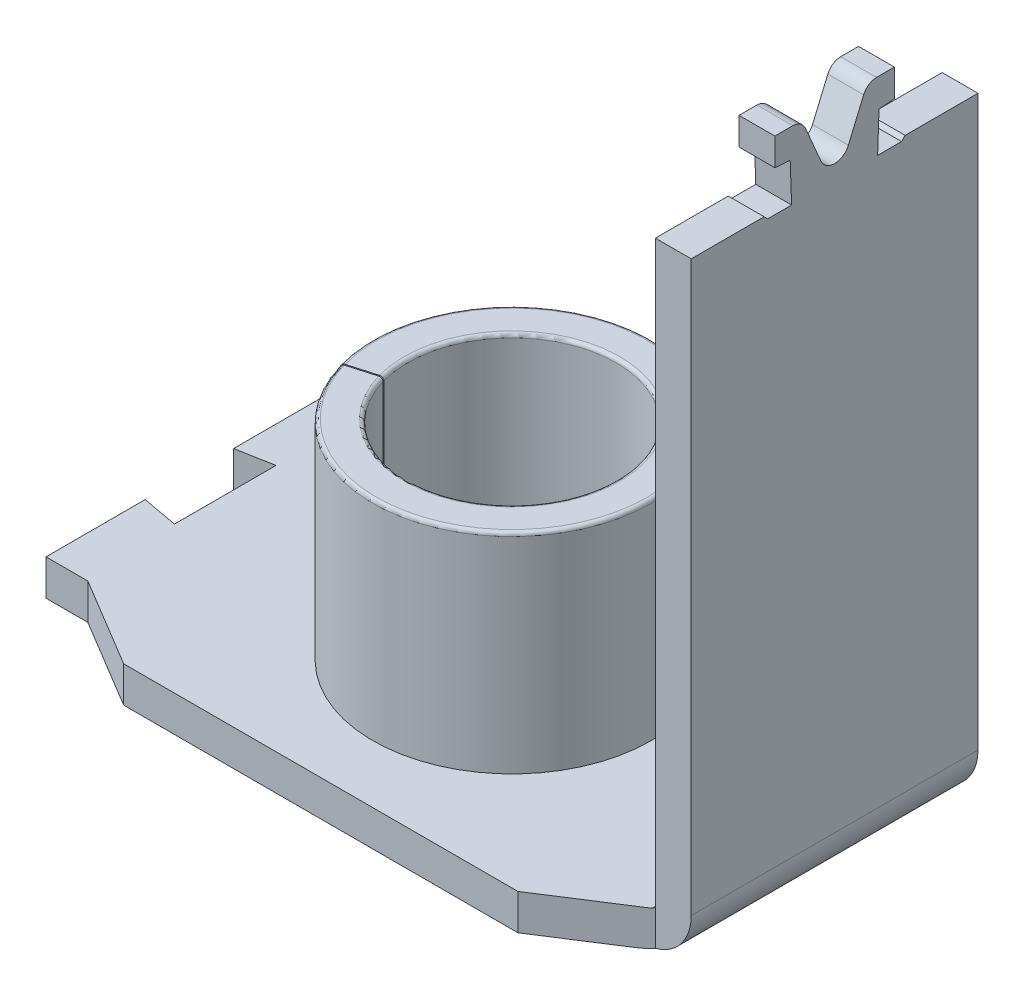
ISO-10303-21;
HEADER;
FILE_DESCRIPTION(('STEP AP214'),'2;1');
FILE_NAME('part.step','',(''),(''),'','','');
FILE_SCHEMA(('AUTOMOTIVE_DESIGN { 1 0 10303 214 1 1 1 1 }'));
ENDSEC;
DATA;
#1=APPLICATION_CONTEXT('core data for automotive mechanical design processes');
#2=APPLICATION_PROTOCOL_DEFINITION('international standard','automotive_design',2000,#1);
#3=PRODUCT_CONTEXT('',#1,'mechanical');
#4=PRODUCT('Part','Part','',(#3));
#5=PRODUCT_RELATED_PRODUCT_CATEGORY('part','',(#4));
#6=PRODUCT_DEFINITION_FORMATION('','',#4);
#7=PRODUCT_DEFINITION_CONTEXT('part definition',#1,'design');
#8=PRODUCT_DEFINITION('design','',#6,#7);
#9=PRODUCT_DEFINITION_SHAPE('','',#8);
#10=(LENGTH_UNIT() NAMED_UNIT(*) SI_UNIT(.MILLI.,.METRE.));
#11=(NAMED_UNIT(*) PLANE_ANGLE_UNIT() SI_UNIT($,.RADIAN.));
#12=(NAMED_UNIT(*) SI_UNIT($,.STERADIAN.) SOLID_ANGLE_UNIT());
#13=UNCERTAINTY_MEASURE_WITH_UNIT(LENGTH_MEASURE(1.E-05),#10,'distance_accuracy_value','');
#14=(GEOMETRIC_REPRESENTATION_CONTEXT(3) GLOBAL_UNCERTAINTY_ASSIGNED_CONTEXT((#13)) GLOBAL_UNIT_ASSIGNED_CONTEXT((#10,
#11,#12)) REPRESENTATION_CONTEXT('',''));
#15=CARTESIAN_POINT('',(0.,0.,0.));
#16=DIRECTION('',(0.,0.,1.));
#17=DIRECTION('',(1.,0.,0.));
#18=AXIS2_PLACEMENT_3D('',#15,#16,#17);
#19=CARTESIAN_POINT('',(-4.00000000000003,0.,16.5));
#20=DIRECTION('',(0.,1.,0.));
#21=DIRECTION('',(-1.,0.,0.));
#22=AXIS2_PLACEMENT_3D('',#19,#20,#21);
#23=PLANE('',#22);
#24=CARTESIAN_POINT('',(-27.,0.,0.));
#25=DIRECTION('',(0.,1.,0.));
#26=DIRECTION('',(-1.,0.,0.));
#27=AXIS2_PLACEMENT_3D('',#24,#25,#26);
#28=CIRCLE('',#27,9.025);
#29=CARTESIAN_POINT('',(-35.676400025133,0.,2.48409090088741));
#30=VERTEX_POINT('',#29);
#31=CARTESIAN_POINT('',(-35.703391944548,0.,2.38780100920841));
#32=VERTEX_POINT('',#31);
#33=EDGE_CURVE('E335',#30,#32,#28,.T.);
#34=ORIENTED_EDGE('',*,*,#33,.T.);
#35=DIRECTION('',(0.961373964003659,0.,-0.275245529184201));
#36=VECTOR('',#35,1.);
#37=CARTESIAN_POINT('',(-35.3756230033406,0.,2.29395934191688));
#38=LINE('',#37,#36);
#39=CARTESIAN_POINT('',(-38.1790481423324,0.,3.09659209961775));
#40=VERTEX_POINT('',#39);
#41=EDGE_CURVE('E338',#40,#32,#38,.T.);
#42=ORIENTED_EDGE('',*,*,#41,.F.);
#43=CARTESIAN_POINT('',(-27.,0.,0.));
#44=DIRECTION('',(0.,-1.,0.));
#45=DIRECTION('',(1.,0.,0.));
#46=AXIS2_PLACEMENT_3D('',#43,#44,#45);
#47=CIRCLE('',#46,11.6);
#48=CARTESIAN_POINT('',(-38.1519379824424,0.,3.19284813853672));
#49=VERTEX_POINT('',#48);
#50=EDGE_CURVE('E337',#40,#49,#47,.T.);
#51=ORIENTED_EDGE('',*,*,#50,.T.);
#52=DIRECTION('',(-0.961373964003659,0.,0.2752455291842));
#53=VECTOR('',#52,1.);
#54=CARTESIAN_POINT('',(-38.1519379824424,0.,3.19284813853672));
#55=LINE('',#54,#53);
#56=EDGE_CURVE('E48',#30,#49,#55,.T.);
#57=ORIENTED_EDGE('',*,*,#56,.F.);
#58=EDGE_LOOP('',(#34,#42,#51,#57));
#59=FACE_BOUND('',#58,.T.);
#60=ADVANCED_FACE('F32',(#59),#23,.F.);
#61=CARTESIAN_POINT('',(0.,57.,16.5));
#62=DIRECTION('',(0.,-1.,0.));
#63=DIRECTION('',(0.,0.,-1.));
#64=AXIS2_PLACEMENT_3D('',#61,#62,#63);
#65=PLANE('',#64);
#66=DIRECTION('',(0.,0.,-1.));
#67=VECTOR('',#66,1.);
#68=CARTESIAN_POINT('',(0.,57.,16.5));
#69=LINE('',#68,#67);
#70=CARTESIAN_POINT('',(0.,57.,5.));
#71=VERTEX_POINT('',#70);
#72=CARTESIAN_POINT('',(0.,57.,3.5));
#73=VERTEX_POINT('',#72);
#74=EDGE_CURVE('E398',#71,#73,#69,.T.);
#75=ORIENTED_EDGE('',*,*,#74,.T.);
#76=DIRECTION('',(-1.,0.,0.));
#77=VECTOR('',#76,1.);
#78=CARTESIAN_POINT('',(0.,57.,3.5));
#79=LINE('',#78,#77);
#80=CARTESIAN_POINT('',(-3.,57.,3.5));
#81=VERTEX_POINT('',#80);
#82=EDGE_CURVE('E602',#73,#81,#79,.T.);
#83=ORIENTED_EDGE('',*,*,#82,.T.);
#84=DIRECTION('',(0.,0.,-1.));
#85=VECTOR('',#84,1.);
#86=CARTESIAN_POINT('',(-3.,57.,16.5));
#87=LINE('',#86,#85);
#88=CARTESIAN_POINT('',(-3.,57.,5.));
#89=VERTEX_POINT('',#88);
#90=EDGE_CURVE('E402',#89,#81,#87,.T.);
#91=ORIENTED_EDGE('',*,*,#90,.F.);
#92=DIRECTION('',(-1.,0.,0.));
#93=VECTOR('',#92,1.);
#94=CARTESIAN_POINT('',(0.,57.,5.));
#95=LINE('',#94,#93);
#96=EDGE_CURVE('E526',#71,#89,#95,.T.);
#97=ORIENTED_EDGE('',*,*,#96,.F.);
#98=EDGE_LOOP('',(#75,#83,#91,#97));
#99=FACE_BOUND('',#98,.T.);
#100=ADVANCED_FACE('F715',(#99),#65,.F.);
#101=CARTESIAN_POINT('',(-54.,0.,16.5));
#102=DIRECTION('',(1.,0.,0.));
#103=DIRECTION('',(0.,0.,-1.));
#104=AXIS2_PLACEMENT_3D('',#101,#102,#103);
#105=PLANE('',#104);
#106=DIRECTION('',(0.,0.,-1.));
#107=VECTOR('',#106,1.);
#108=CARTESIAN_POINT('',(-54.,2.99999999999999,16.5));
#109=LINE('',#108,#107);
#110=CARTESIAN_POINT('',(-54.,3.,-3.7));
#111=VERTEX_POINT('',#110);
#112=CARTESIAN_POINT('',(-54.,2.99999999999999,-12.));
#113=VERTEX_POINT('',#112);
#114=EDGE_CURVE('E413',#111,#113,#109,.T.);
#115=ORIENTED_EDGE('',*,*,#114,.T.);
#116=DIRECTION('',(0.,-1.,0.));
#117=VECTOR('',#116,1.);
#118=CARTESIAN_POINT('',(-54.,0.,-12.));
#119=LINE('',#118,#117);
#120=CARTESIAN_POINT('',(-54.,0.,-12.));
#121=VERTEX_POINT('',#120);
#122=EDGE_CURVE('E361',#113,#121,#119,.T.);
#123=ORIENTED_EDGE('',*,*,#122,.T.);
#124=DIRECTION('',(0.,0.,-1.));
#125=VECTOR('',#124,1.);
#126=CARTESIAN_POINT('',(-54.,0.,16.5));
#127=LINE('',#126,#125);
#128=CARTESIAN_POINT('',(-54.,0.,-3.7));
#129=VERTEX_POINT('',#128);
#130=EDGE_CURVE('E389',#129,#121,#127,.T.);
#131=ORIENTED_EDGE('',*,*,#130,.F.);
#132=DIRECTION('',(0.,1.,0.));
#133=VECTOR('',#132,1.);
#134=CARTESIAN_POINT('',(-54.,0.,-3.7));
#135=LINE('',#134,#133);
#136=EDGE_CURVE('E364',#129,#111,#135,.T.);
#137=ORIENTED_EDGE('',*,*,#136,.T.);
#138=EDGE_LOOP('',(#115,#123,#131,#137));
#139=FACE_BOUND('',#138,.T.);
#140=ADVANCED_FACE('F721',(#139),#105,.F.);
#141=CARTESIAN_POINT('',(-27.,0.,0.));
#142=DIRECTION('',(0.,-1.,0.));
#143=DIRECTION('',(1.,0.,0.));
#144=AXIS2_PLACEMENT_3D('',#141,#142,#143);
#145=CIRCLE('',#144,11.65);
#146=CARTESIAN_POINT('',(-15.35,0.,0.));
#147=VERTEX_POINT('',#146);
#148=EDGE_CURVE('E659',#147,#147,#145,.T.);
#149=ORIENTED_EDGE('',*,*,#148,.F.);
#150=EDGE_LOOP('',(#149));
#151=FACE_BOUND('',#150,.T.);
#152=DIRECTION('',(0.,0.,-1.));
#153=VECTOR('',#152,1.);
#154=CARTESIAN_POINT('',(-4.00000000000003,0.,16.5));
#155=LINE('',#154,#153);
#156=CARTESIAN_POINT('',(-4.00000000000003,0.,12.6428571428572));
#157=VERTEX_POINT('',#156);
#158=CARTESIAN_POINT('',(-4.00000000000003,0.,-12.6428571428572));
#159=VERTEX_POINT('',#158);
#160=EDGE_CURVE('E392',#157,#159,#155,.T.);
#161=ORIENTED_EDGE('',*,*,#160,.F.);
#162=DIRECTION('',(-0.841178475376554,0.,0.540757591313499));
#163=VECTOR('',#162,1.);
#164=CARTESIAN_POINT('',(-5.75451263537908,0.,13.7707581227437));
#165=LINE('',#164,#163);
#166=CARTESIAN_POINT('',(-9.99999999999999,0.,16.5));
#167=VERTEX_POINT('',#166);
#168=EDGE_CURVE('E459',#157,#167,#165,.T.);
#169=ORIENTED_EDGE('',*,*,#168,.T.);
#170=DIRECTION('',(1.,0.,0.));
#171=VECTOR('',#170,1.);
#172=CARTESIAN_POINT('',(-4.00000000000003,0.,16.5));
#173=LINE('',#172,#171);
#174=CARTESIAN_POINT('',(-43.,0.,16.5));
#175=VERTEX_POINT('',#174);
#176=EDGE_CURVE('E419',#175,#167,#173,.T.);
#177=ORIENTED_EDGE('',*,*,#176,.F.);
#178=DIRECTION('',(-0.857429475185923,0.,-0.514601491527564));
#179=VECTOR('',#178,1.);
#180=CARTESIAN_POINT('',(-14.3277731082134,0.,33.7081449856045));
#181=LINE('',#180,#179);
#182=CARTESIAN_POINT('',(-50.49790411,0.,12.));
#183=VERTEX_POINT('',#182);
#184=EDGE_CURVE('E471',#175,#183,#181,.T.);
#185=ORIENTED_EDGE('',*,*,#184,.T.);
#186=DIRECTION('',(-1.,0.,0.));
#187=VECTOR('',#186,1.);
#188=CARTESIAN_POINT('',(-4.00000000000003,0.,12.));
#189=LINE('',#188,#187);
#190=CARTESIAN_POINT('',(-54.,0.,12.));
#191=VERTEX_POINT('',#190);
#192=EDGE_CURVE('E447',#183,#191,#189,.T.);
#193=ORIENTED_EDGE('',*,*,#192,.T.);
#194=CARTESIAN_POINT('',(-54.,0.,3.7));
#195=VERTEX_POINT('',#194);
#196=EDGE_CURVE('E383',#191,#195,#127,.T.);
#197=ORIENTED_EDGE('',*,*,#196,.T.);
#198=DIRECTION('',(0.983606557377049,0.,0.180327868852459));
#199=VECTOR('',#198,1.);
#200=CARTESIAN_POINT('',(-3.35554958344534,0.,12.9848159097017));
#201=LINE('',#200,#199);
#202=CARTESIAN_POINT('',(-51.,0.,4.25));
#203=VERTEX_POINT('',#202);
#204=EDGE_CURVE('E441',#195,#203,#201,.T.);
#205=ORIENTED_EDGE('',*,*,#204,.T.);
#206=DIRECTION('',(0.,0.,-1.));
#207=VECTOR('',#206,1.);
#208=CARTESIAN_POINT('',(-51.,0.,16.5));
#209=LINE('',#208,#207);
#210=CARTESIAN_POINT('',(-51.,0.,-4.25));
#211=VERTEX_POINT('',#210);
#212=EDGE_CURVE('E388',#203,#211,#209,.T.);
#213=ORIENTED_EDGE('',*,*,#212,.T.);
#214=DIRECTION('',(-0.983606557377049,0.,0.180327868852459));
#215=VECTOR('',#214,1.);
#216=CARTESIAN_POINT('',(-9.20881483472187,0.,-11.911717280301));
#217=LINE('',#216,#215);
#218=EDGE_CURVE('E435',#211,#129,#217,.T.);
#219=ORIENTED_EDGE('',*,*,#218,.T.);
#220=ORIENTED_EDGE('',*,*,#130,.T.);
#221=DIRECTION('',(1.,0.,0.));
#222=VECTOR('',#221,1.);
#223=CARTESIAN_POINT('',(-4.00000000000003,0.,-12.));
#224=LINE('',#223,#222);
#225=CARTESIAN_POINT('',(-50.49790411,0.,-12.));
#226=VERTEX_POINT('',#225);
#227=EDGE_CURVE('E429',#121,#226,#224,.T.);
#228=ORIENTED_EDGE('',*,*,#227,.T.);
#229=DIRECTION('',(0.857429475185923,0.,-0.514601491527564));
#230=VECTOR('',#229,1.);
#231=CARTESIAN_POINT('',(-28.8885111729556,0.,-24.9692600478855));
#232=LINE('',#231,#230);
#233=CARTESIAN_POINT('',(-43.,0.,-16.5));
#234=VERTEX_POINT('',#233);
#235=EDGE_CURVE('E489',#226,#234,#232,.T.);
#236=ORIENTED_EDGE('',*,*,#235,.T.);
#237=DIRECTION('',(1.,0.,0.));
#238=VECTOR('',#237,1.);
#239=CARTESIAN_POINT('',(-4.00000000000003,0.,-16.5));
#240=LINE('',#239,#238);
#241=CARTESIAN_POINT('',(-10.,0.,-16.5));
#242=VERTEX_POINT('',#241);
#243=EDGE_CURVE('E387',#234,#242,#240,.T.);
#244=ORIENTED_EDGE('',*,*,#243,.T.);
#245=DIRECTION('',(0.841178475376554,0.,0.540757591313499));
#246=VECTOR('',#245,1.);
#247=CARTESIAN_POINT('',(9.25631768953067,0.,-4.12093862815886));
#248=LINE('',#247,#246);
#249=EDGE_CURVE('E477',#242,#159,#248,.T.);
#250=ORIENTED_EDGE('',*,*,#249,.T.);
#251=EDGE_LOOP('',(#161,#169,#177,#185,#193,#197,#205,#213,#219,#220,#228,#236,#244,#250));
#252=FACE_BOUND('',#251,.T.);
#253=ADVANCED_FACE('F717',(#151,#252),#23,.F.);
#254=CARTESIAN_POINT('',(-3.2,3.,16.5));
#255=DIRECTION('',(0.,-1.,0.));
#256=DIRECTION('',(1.,0.,0.));
#257=AXIS2_PLACEMENT_3D('',#254,#255,#256);
#258=PLANE('',#257);
#259=DIRECTION('',(-1.,0.,0.));
#260=VECTOR('',#259,1.);
#261=CARTESIAN_POINT('',(-3.2,3.,16.5));
#262=LINE('',#261,#260);
#263=CARTESIAN_POINT('',(-10.,3.,16.5));
#264=VERTEX_POINT('',#263);
#265=CARTESIAN_POINT('',(-43.,3.,16.5));
#266=VERTEX_POINT('',#265);
#267=EDGE_CURVE('E416',#264,#266,#262,.T.);
#268=ORIENTED_EDGE('',*,*,#267,.F.);
#269=DIRECTION('',(0.841178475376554,0.,-0.540757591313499));
#270=VECTOR('',#269,1.);
#271=CARTESIAN_POINT('',(-5.1884476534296,3.,13.4068592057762));
#272=LINE('',#271,#270);
#273=CARTESIAN_POINT('',(-3.2,3.,12.1285714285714));
#274=VERTEX_POINT('',#273);
#275=EDGE_CURVE('E465',#264,#274,#272,.T.);
#276=ORIENTED_EDGE('',*,*,#275,.T.);
#277=DIRECTION('',(0.,0.,-1.));
#278=VECTOR('',#277,1.);
#279=CARTESIAN_POINT('',(-3.2,3.,16.5));
#280=LINE('',#279,#278);
#281=CARTESIAN_POINT('',(-3.2,3.,-12.1285714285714));
#282=VERTEX_POINT('',#281);
#283=EDGE_CURVE('E409',#274,#282,#280,.T.);
#284=ORIENTED_EDGE('',*,*,#283,.T.);
#285=DIRECTION('',(-0.841178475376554,0.,-0.540757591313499));
#286=VECTOR('',#285,1.);
#287=CARTESIAN_POINT('',(9.82238267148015,3.,-3.75703971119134));
#288=LINE('',#287,#286);
#289=CARTESIAN_POINT('',(-9.99999999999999,3.,-16.5));
#290=VERTEX_POINT('',#289);
#291=EDGE_CURVE('E483',#282,#290,#288,.T.);
#292=ORIENTED_EDGE('',*,*,#291,.T.);
#293=DIRECTION('',(-1.,0.,0.));
#294=VECTOR('',#293,1.);
#295=CARTESIAN_POINT('',(-3.2,3.,-16.5));
#296=LINE('',#295,#294);
#297=CARTESIAN_POINT('',(-43.,3.,-16.5));
#298=VERTEX_POINT('',#297);
#299=EDGE_CURVE('E422',#290,#298,#296,.T.);
#300=ORIENTED_EDGE('',*,*,#299,.T.);
#301=DIRECTION('',(-0.857429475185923,0.,0.514601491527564));
#302=VECTOR('',#301,1.);
#303=CARTESIAN_POINT('',(-28.3003629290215,3.,-25.3222476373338));
#304=LINE('',#303,#302);
#305=CARTESIAN_POINT('',(-50.49790411,3.,-12.));
#306=VERTEX_POINT('',#305);
#307=EDGE_CURVE('E492',#298,#306,#304,.T.);
#308=ORIENTED_EDGE('',*,*,#307,.T.);
#309=DIRECTION('',(-1.,0.,0.));
#310=VECTOR('',#309,1.);
#311=CARTESIAN_POINT('',(-3.2,3.,-12.));
#312=LINE('',#311,#310);
#313=EDGE_CURVE('E432',#306,#113,#312,.T.);
#314=ORIENTED_EDGE('',*,*,#313,.T.);
#315=ORIENTED_EDGE('',*,*,#114,.F.);
#316=DIRECTION('',(0.983606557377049,0.,-0.180327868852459));
#317=VECTOR('',#316,1.);
#318=CARTESIAN_POINT('',(-8.43482934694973,3.,-12.0536146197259));
#319=LINE('',#318,#317);
#320=CARTESIAN_POINT('',(-51.,3.,-4.25));
#321=VERTEX_POINT('',#320);
#322=EDGE_CURVE('E438',#111,#321,#319,.T.);
#323=ORIENTED_EDGE('',*,*,#322,.T.);
#324=DIRECTION('',(0.,0.,1.));
#325=VECTOR('',#324,1.);
#326=CARTESIAN_POINT('',(-51.,2.99999999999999,16.5));
#327=LINE('',#326,#325);
#328=CARTESIAN_POINT('',(-51.,3.,4.25));
#329=VERTEX_POINT('',#328);
#330=EDGE_CURVE('E358',#321,#329,#327,.T.);
#331=ORIENTED_EDGE('',*,*,#330,.T.);
#332=DIRECTION('',(-0.983606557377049,0.,-0.180327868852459));
#333=VECTOR('',#332,1.);
#334=CARTESIAN_POINT('',(-2.58156409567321,3.,13.1267132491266));
#335=LINE('',#334,#333);
#336=CARTESIAN_POINT('',(-54.,3.,3.7));
#337=VERTEX_POINT('',#336);
#338=EDGE_CURVE('E444',#329,#337,#335,.T.);
#339=ORIENTED_EDGE('',*,*,#338,.T.);
#340=CARTESIAN_POINT('',(-54.,2.99999999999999,12.));
#341=VERTEX_POINT('',#340);
#342=EDGE_CURVE('E412',#341,#337,#109,.T.);
#343=ORIENTED_EDGE('',*,*,#342,.F.);
#344=DIRECTION('',(1.,0.,0.));
#345=VECTOR('',#344,1.);
#346=CARTESIAN_POINT('',(-3.2,3.,12.));
#347=LINE('',#346,#345);
#348=CARTESIAN_POINT('',(-50.49790411,3.,12.));
#349=VERTEX_POINT('',#348);
#350=EDGE_CURVE('E450',#341,#349,#347,.T.);
#351=ORIENTED_EDGE('',*,*,#350,.T.);
#352=DIRECTION('',(0.857429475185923,0.,0.514601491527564));
#353=VECTOR('',#352,1.);
#354=CARTESIAN_POINT('',(-13.7396248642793,3.,34.0611325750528));
#355=LINE('',#354,#353);
#356=EDGE_CURVE('E474',#349,#266,#355,.T.);
#357=ORIENTED_EDGE('',*,*,#356,.T.);
#358=EDGE_LOOP('',(#268,#276,#284,#292,#300,#308,#314,#315,#323,#331,#339,#343,#351,#357));
#359=FACE_BOUND('',#358,.T.);
#360=CARTESIAN_POINT('',(-27.,3.,0.));
#361=DIRECTION('',(0.,-1.,0.));
#362=DIRECTION('',(1.,0.,0.));
#363=AXIS2_PLACEMENT_3D('',#360,#361,#362);
#364=CIRCLE('',#363,11.65);
#365=CARTESIAN_POINT('',(-15.35,3.,0.));
#366=VERTEX_POINT('',#365);
#367=EDGE_CURVE('E384',#366,#366,#364,.F.);
#368=ORIENTED_EDGE('',*,*,#367,.F.);
#369=EDGE_LOOP('',(#368));
#370=FACE_BOUND('',#369,.T.);
#371=ADVANCED_FACE('F727',(#359,#370),#258,.F.);
#372=ORIENTED_EDGE('',*,*,#342,.T.);
#373=DIRECTION('',(0.,-1.,0.));
#374=VECTOR('',#373,1.);
#375=CARTESIAN_POINT('',(-54.,0.,3.7));
#376=LINE('',#375,#374);
#377=EDGE_CURVE('E367',#337,#195,#376,.T.);
#378=ORIENTED_EDGE('',*,*,#377,.T.);
#379=ORIENTED_EDGE('',*,*,#196,.F.);
#380=DIRECTION('',(0.,1.,0.));
#381=VECTOR('',#380,1.);
#382=CARTESIAN_POINT('',(-54.,0.,12.));
#383=LINE('',#382,#381);
#384=EDGE_CURVE('E370',#191,#341,#383,.T.);
#385=ORIENTED_EDGE('',*,*,#384,.T.);
#386=EDGE_LOOP('',(#372,#378,#379,#385));
#387=FACE_BOUND('',#386,.T.);
#388=ADVANCED_FACE('F733',(#387),#105,.F.);
#389=CARTESIAN_POINT('',(-4.,4.,16.5));
#390=DIRECTION('',(0.,0.,-1.));
#391=DIRECTION('',(-1.,0.,0.));
#392=AXIS2_PLACEMENT_3D('',#389,#390,#391);
#393=CYLINDRICAL_SURFACE('',#392,4.);
#394=CARTESIAN_POINT('',(-4.,4.,12.));
#395=DIRECTION('',(0.,0.,-1.));
#396=DIRECTION('',(-1.,0.,0.));
#397=AXIS2_PLACEMENT_3D('',#394,#395,#396);
#398=CIRCLE('',#397,4.);
#399=CARTESIAN_POINT('',(0.,4.00000000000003,12.));
#400=VERTEX_POINT('',#399);
#401=CARTESIAN_POINT('',(-2.99999999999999,0.127016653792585,12.));
#402=VERTEX_POINT('',#401);
#403=EDGE_CURVE('E453',#400,#402,#398,.T.);
#404=ORIENTED_EDGE('',*,*,#403,.T.);
#405=CARTESIAN_POINT('',(-4.,4.,12.6428571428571));
#406=DIRECTION('',(-0.540757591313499,0.,-0.841178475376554));
#407=DIRECTION('',(0.841178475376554,0.,-0.540757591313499));
#408=AXIS2_PLACEMENT_3D('',#405,#406,#407);
#409=ELLIPSE('',#408,4.75523342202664,4.);
#410=EDGE_CURVE('E462',#402,#157,#409,.T.);
#411=ORIENTED_EDGE('',*,*,#410,.T.);
#412=ORIENTED_EDGE('',*,*,#160,.T.);
#413=CARTESIAN_POINT('',(-4.,4.,-12.6428571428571));
#414=DIRECTION('',(-0.540757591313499,0.,0.841178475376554));
#415=DIRECTION('',(-0.841178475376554,0.,-0.540757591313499));
#416=AXIS2_PLACEMENT_3D('',#413,#414,#415);
#417=ELLIPSE('',#416,4.75523342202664,4.);
#418=CARTESIAN_POINT('',(-2.99999999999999,0.127016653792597,-12.));
#419=VERTEX_POINT('',#418);
#420=EDGE_CURVE('E480',#159,#419,#417,.T.);
#421=ORIENTED_EDGE('',*,*,#420,.T.);
#422=CARTESIAN_POINT('',(-4.,4.,-12.));
#423=DIRECTION('',(0.,0.,1.));
#424=DIRECTION('',(1.,0.,0.));
#425=AXIS2_PLACEMENT_3D('',#422,#423,#424);
#426=CIRCLE('',#425,4.);
#427=CARTESIAN_POINT('',(0.,4.00000000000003,-12.));
#428=VERTEX_POINT('',#427);
#429=EDGE_CURVE('E456',#419,#428,#426,.T.);
#430=ORIENTED_EDGE('',*,*,#429,.T.);
#431=DIRECTION('',(0.,0.,-1.));
#432=VECTOR('',#431,1.);
#433=CARTESIAN_POINT('',(0.,4.00000000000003,16.5));
#434=LINE('',#433,#432);
#435=EDGE_CURVE('E395',#400,#428,#434,.T.);
#436=ORIENTED_EDGE('',*,*,#435,.F.);
#437=EDGE_LOOP('',(#404,#411,#412,#421,#430,#436));
#438=FACE_BOUND('',#437,.T.);
#439=ADVANCED_FACE('F742',(#438),#393,.T.);
#440=CARTESIAN_POINT('',(0.,4.00000000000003,16.5));
#441=DIRECTION('',(-1.,0.,0.));
#442=DIRECTION('',(0.,0.,1.));
#443=AXIS2_PLACEMENT_3D('',#440,#441,#442);
#444=PLANE('',#443);
#445=DIRECTION('',(0.,0.920138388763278,0.391593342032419));
#446=VECTOR('',#445,1.);
#447=CARTESIAN_POINT('',(0.,53.2605083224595,1.1501729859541));
#448=LINE('',#447,#446);
#449=CARTESIAN_POINT('',(0.,53.2605083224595,1.1501729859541));
#450=VERTEX_POINT('',#449);
#451=CARTESIAN_POINT('',(0.,56.270431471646,2.43113884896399));
#452=VERTEX_POINT('',#451);
#453=EDGE_CURVE('E648',#450,#452,#448,.T.);
#454=ORIENTED_EDGE('',*,*,#453,.T.);
#455=CARTESIAN_POINT('',(0.,55.8005194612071,3.53530491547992));
#456=DIRECTION('',(1.,0.,0.));
#457=DIRECTION('',(0.,-1.,0.));
#458=AXIS2_PLACEMENT_3D('',#455,#456,#457);
#459=CIRCLE('',#458,1.2);
#460=EDGE_CURVE('E621',#452,#73,#459,.T.);
#461=ORIENTED_EDGE('',*,*,#460,.T.);
#462=ORIENTED_EDGE('',*,*,#74,.F.);
#463=DIRECTION('',(0.,-1.,0.));
#464=VECTOR('',#463,1.);
#465=CARTESIAN_POINT('',(0.,54.7,5.));
#466=LINE('',#465,#464);
#467=CARTESIAN_POINT('',(0.,54.7,5.));
#468=VERTEX_POINT('',#467);
#469=EDGE_CURVE('E557',#71,#468,#466,.T.);
#470=ORIENTED_EDGE('',*,*,#469,.T.);
#471=DIRECTION('',(0.,-0.0776338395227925,-0.996981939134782));
#472=VECTOR('',#471,1.);
#473=CARTESIAN_POINT('',(0.,54.6,3.71578947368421));
#474=LINE('',#473,#472);
#475=CARTESIAN_POINT('',(0.,54.6,3.71578947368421));
#476=VERTEX_POINT('',#475);
#477=EDGE_CURVE('E554',#468,#476,#474,.T.);
#478=ORIENTED_EDGE('',*,*,#477,.T.);
#479=DIRECTION('',(0.,-0.999384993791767,-0.0350661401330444));
#480=VECTOR('',#479,1.);
#481=CARTESIAN_POINT('',(0.,51.3,3.6));
#482=LINE('',#481,#480);
#483=CARTESIAN_POINT('',(0.,51.3,3.6));
#484=VERTEX_POINT('',#483);
#485=EDGE_CURVE('E521',#476,#484,#482,.T.);
#486=ORIENTED_EDGE('',*,*,#485,.T.);
#487=DIRECTION('',(0.,0.,1.));
#488=VECTOR('',#487,1.);
#489=CARTESIAN_POINT('',(0.,51.3,3.6));
#490=LINE('',#489,#488);
#491=CARTESIAN_POINT('',(0.,51.3,5.6));
#492=VERTEX_POINT('',#491);
#493=EDGE_CURVE('E536',#484,#492,#490,.T.);
#494=ORIENTED_EDGE('',*,*,#493,.T.);
#495=DIRECTION('',(0.,0.707106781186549,0.707106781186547));
#496=VECTOR('',#495,1.);
#497=CARTESIAN_POINT('',(0.,51.3,5.6));
#498=LINE('',#497,#496);
#499=CARTESIAN_POINT('',(0.,51.6,5.9));
#500=VERTEX_POINT('',#499);
#501=EDGE_CURVE('E563',#492,#500,#498,.T.);
#502=ORIENTED_EDGE('',*,*,#501,.T.);
#503=DIRECTION('',(0.,0.,1.));
#504=VECTOR('',#503,1.);
#505=CARTESIAN_POINT('',(0.,51.6,5.9));
#506=LINE('',#505,#504);
#507=CARTESIAN_POINT('',(0.,51.6,12.));
#508=VERTEX_POINT('',#507);
#509=EDGE_CURVE('E560',#500,#508,#506,.T.);
#510=ORIENTED_EDGE('',*,*,#509,.T.);
#511=DIRECTION('',(0.,-1.,0.));
#512=VECTOR('',#511,1.);
#513=CARTESIAN_POINT('',(0.,57.,12.));
#514=LINE('',#513,#512);
#515=EDGE_CURVE('E498',#508,#400,#514,.T.);
#516=ORIENTED_EDGE('',*,*,#515,.T.);
#517=ORIENTED_EDGE('',*,*,#435,.T.);
#518=DIRECTION('',(0.,-1.,0.));
#519=VECTOR('',#518,1.);
#520=CARTESIAN_POINT('',(0.,57.,-12.));
#521=LINE('',#520,#519);
#522=CARTESIAN_POINT('',(0.,51.6,-12.));
#523=VERTEX_POINT('',#522);
#524=EDGE_CURVE('E500',#523,#428,#521,.T.);
#525=ORIENTED_EDGE('',*,*,#524,.F.);
#526=DIRECTION('',(0.,0.,1.));
#527=VECTOR('',#526,1.);
#528=CARTESIAN_POINT('',(0.,51.6,-5.9));
#529=LINE('',#528,#527);
#530=CARTESIAN_POINT('',(0.,51.6,-5.9));
#531=VERTEX_POINT('',#530);
#532=EDGE_CURVE('E611',#523,#531,#529,.T.);
#533=ORIENTED_EDGE('',*,*,#532,.T.);
#534=DIRECTION('',(0.,-0.707106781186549,0.707106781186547));
#535=VECTOR('',#534,1.);
#536=CARTESIAN_POINT('',(0.,51.3,-5.6));
#537=LINE('',#536,#535);
#538=CARTESIAN_POINT('',(0.,51.3,-5.6));
#539=VERTEX_POINT('',#538);
#540=EDGE_CURVE('E608',#531,#539,#537,.T.);
#541=ORIENTED_EDGE('',*,*,#540,.T.);
#542=DIRECTION('',(0.,0.,1.));
#543=VECTOR('',#542,1.);
#544=CARTESIAN_POINT('',(0.,51.3,-3.6));
#545=LINE('',#544,#543);
#546=CARTESIAN_POINT('',(0.,51.3,-3.6));
#547=VERTEX_POINT('',#546);
#548=EDGE_CURVE('E605',#539,#547,#545,.T.);
#549=ORIENTED_EDGE('',*,*,#548,.T.);
#550=DIRECTION('',(0.,0.999384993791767,-0.0350661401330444));
#551=VECTOR('',#550,1.);
#552=CARTESIAN_POINT('',(0.,51.3,-3.6));
#553=LINE('',#552,#551);
#554=CARTESIAN_POINT('',(0.,54.6,-3.71578947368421));
#555=VERTEX_POINT('',#554);
#556=EDGE_CURVE('E571',#547,#555,#553,.T.);
#557=ORIENTED_EDGE('',*,*,#556,.T.);
#558=DIRECTION('',(0.,0.0776338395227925,-0.996981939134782));
#559=VECTOR('',#558,1.);
#560=CARTESIAN_POINT('',(0.,54.6,-3.71578947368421));
#561=LINE('',#560,#559);
#562=CARTESIAN_POINT('',(0.,54.7,-5.));
#563=VERTEX_POINT('',#562);
#564=EDGE_CURVE('E586',#555,#563,#561,.T.);
#565=ORIENTED_EDGE('',*,*,#564,.T.);
#566=DIRECTION('',(0.,1.,0.));
#567=VECTOR('',#566,1.);
#568=CARTESIAN_POINT('',(0.,54.7,-5.));
#569=LINE('',#568,#567);
#570=CARTESIAN_POINT('',(0.,57.,-5.));
#571=VERTEX_POINT('',#570);
#572=EDGE_CURVE('E614',#563,#571,#569,.T.);
#573=ORIENTED_EDGE('',*,*,#572,.T.);
#574=CARTESIAN_POINT('',(0.,57.,-3.5));
#575=VERTEX_POINT('',#574);
#576=EDGE_CURVE('E401',#575,#571,#69,.T.);
#577=ORIENTED_EDGE('',*,*,#576,.F.);
#578=CARTESIAN_POINT('',(0.,55.8005194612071,-3.53530491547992));
#579=DIRECTION('',(1.,0.,0.));
#580=DIRECTION('',(0.,1.,0.));
#581=AXIS2_PLACEMENT_3D('',#578,#579,#580);
#582=CIRCLE('',#581,1.2);
#583=CARTESIAN_POINT('',(0.,56.270431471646,-2.43113884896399));
#584=VERTEX_POINT('',#583);
#585=EDGE_CURVE('E633',#575,#584,#582,.T.);
#586=ORIENTED_EDGE('',*,*,#585,.T.);
#587=DIRECTION('',(0.,-0.920138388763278,0.391593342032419));
#588=VECTOR('',#587,1.);
#589=CARTESIAN_POINT('',(0.,53.2605083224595,-1.1501729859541));
#590=LINE('',#589,#588);
#591=CARTESIAN_POINT('',(0.,53.2605083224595,-1.1501729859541));
#592=VERTEX_POINT('',#591);
#593=EDGE_CURVE('E654',#584,#592,#590,.T.);
#594=ORIENTED_EDGE('',*,*,#593,.T.);
#595=CARTESIAN_POINT('',(0.,53.75,0.));
#596=DIRECTION('',(-1.,0.,0.));
#597=DIRECTION('',(0.,-1.,0.));
#598=AXIS2_PLACEMENT_3D('',#595,#596,#597);
#599=CIRCLE('',#598,1.25);
#600=EDGE_CURVE('E651',#592,#450,#599,.T.);
#601=ORIENTED_EDGE('',*,*,#600,.T.);
#602=EDGE_LOOP('',(#454,#461,#462,#470,#478,#486,#494,#502,#510,#516,#517,#525,#533,#541,#549,
#557,#565,#573,#577,#586,#594,#601));
#603=FACE_BOUND('',#602,.T.);
#604=ADVANCED_FACE('F808',(#603),#444,.F.);
#605=CARTESIAN_POINT('',(-3.,57.,-3.49999999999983));
#606=VERTEX_POINT('',#605);
#607=CARTESIAN_POINT('',(-3.,57.,-5.));
#608=VERTEX_POINT('',#607);
#609=EDGE_CURVE('E405',#606,#608,#87,.T.);
#610=ORIENTED_EDGE('',*,*,#609,.F.);
#611=DIRECTION('',(-1.,0.,0.));
#612=VECTOR('',#611,1.);
#613=CARTESIAN_POINT('',(0.,57.,-3.5));
#614=LINE('',#613,#612);
#615=EDGE_CURVE('E56',#575,#606,#614,.T.);
#616=ORIENTED_EDGE('',*,*,#615,.F.);
#617=ORIENTED_EDGE('',*,*,#576,.T.);
#618=DIRECTION('',(-1.,0.,0.));
#619=VECTOR('',#618,1.);
#620=CARTESIAN_POINT('',(0.,57.,-5.));
#621=LINE('',#620,#619);
#622=EDGE_CURVE('E570',#571,#608,#621,.T.);
#623=ORIENTED_EDGE('',*,*,#622,.T.);
#624=EDGE_LOOP('',(#610,#616,#617,#623));
#625=FACE_BOUND('',#624,.T.);
#626=ADVANCED_FACE('F724',(#625),#65,.F.);
#627=CARTESIAN_POINT('',(-3.,3.2,16.5));
#628=DIRECTION('',(1.,0.,0.));
#629=DIRECTION('',(0.,1.,0.));
#630=AXIS2_PLACEMENT_3D('',#627,#628,#629);
#631=PLANE('',#630);
#632=ORIENTED_EDGE('',*,*,#90,.T.);
#633=CARTESIAN_POINT('',(-3.,55.8005194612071,3.53530491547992));
#634=DIRECTION('',(1.,0.,0.));
#635=DIRECTION('',(0.,-1.,0.));
#636=AXIS2_PLACEMENT_3D('',#633,#634,#635);
#637=CIRCLE('',#636,1.2);
#638=CARTESIAN_POINT('',(-3.,56.270431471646,2.43113884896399));
#639=VERTEX_POINT('',#638);
#640=EDGE_CURVE('E631',#639,#81,#637,.T.);
#641=ORIENTED_EDGE('',*,*,#640,.F.);
#642=DIRECTION('',(0.,0.920138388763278,0.391593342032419));
#643=VECTOR('',#642,1.);
#644=CARTESIAN_POINT('',(-3.,53.2605083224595,1.1501729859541));
#645=LINE('',#644,#643);
#646=CARTESIAN_POINT('',(-3.,53.2605083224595,1.1501729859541));
#647=VERTEX_POINT('',#646);
#648=EDGE_CURVE('E634',#647,#639,#645,.T.);
#649=ORIENTED_EDGE('',*,*,#648,.F.);
#650=CARTESIAN_POINT('',(-3.,53.75,0.));
#651=DIRECTION('',(-1.,0.,0.));
#652=DIRECTION('',(0.,-1.,0.));
#653=AXIS2_PLACEMENT_3D('',#650,#651,#652);
#654=CIRCLE('',#653,1.25);
#655=CARTESIAN_POINT('',(-3.,53.2605083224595,-1.1501729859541));
#656=VERTEX_POINT('',#655);
#657=EDGE_CURVE('E637',#656,#647,#654,.T.);
#658=ORIENTED_EDGE('',*,*,#657,.F.);
#659=DIRECTION('',(0.,-0.920138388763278,0.391593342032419));
#660=VECTOR('',#659,1.);
#661=CARTESIAN_POINT('',(-3.,53.2605083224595,-1.1501729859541));
#662=LINE('',#661,#660);
#663=CARTESIAN_POINT('',(-3.,56.270431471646,-2.43113884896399));
#664=VERTEX_POINT('',#663);
#665=EDGE_CURVE('E640',#664,#656,#662,.T.);
#666=ORIENTED_EDGE('',*,*,#665,.F.);
#667=CARTESIAN_POINT('',(-3.,55.8005194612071,-3.53530491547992));
#668=DIRECTION('',(1.,0.,0.));
#669=DIRECTION('',(0.,1.,0.));
#670=AXIS2_PLACEMENT_3D('',#667,#668,#669);
#671=CIRCLE('',#670,1.2);
#672=EDGE_CURVE('E643',#606,#664,#671,.T.);
#673=ORIENTED_EDGE('',*,*,#672,.F.);
#674=ORIENTED_EDGE('',*,*,#609,.T.);
#675=DIRECTION('',(0.,1.,0.));
#676=VECTOR('',#675,1.);
#677=CARTESIAN_POINT('',(-3.,54.7,-5.));
#678=LINE('',#677,#676);
#679=CARTESIAN_POINT('',(-3.,54.7,-5.));
#680=VERTEX_POINT('',#679);
#681=EDGE_CURVE('E596',#680,#608,#678,.T.);
#682=ORIENTED_EDGE('',*,*,#681,.F.);
#683=DIRECTION('',(0.,0.0776338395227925,-0.996981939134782));
#684=VECTOR('',#683,1.);
#685=CARTESIAN_POINT('',(-3.,54.6,-3.71578947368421));
#686=LINE('',#685,#684);
#687=CARTESIAN_POINT('',(-3.,54.6,-3.71578947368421));
#688=VERTEX_POINT('',#687);
#689=EDGE_CURVE('E599',#688,#680,#686,.T.);
#690=ORIENTED_EDGE('',*,*,#689,.F.);
#691=DIRECTION('',(0.,0.999384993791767,-0.0350661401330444));
#692=VECTOR('',#691,1.);
#693=CARTESIAN_POINT('',(-3.,51.3,-3.6));
#694=LINE('',#693,#692);
#695=CARTESIAN_POINT('',(-3.,51.3,-3.6));
#696=VERTEX_POINT('',#695);
#697=EDGE_CURVE('E583',#696,#688,#694,.T.);
#698=ORIENTED_EDGE('',*,*,#697,.F.);
#699=DIRECTION('',(0.,0.,1.));
#700=VECTOR('',#699,1.);
#701=CARTESIAN_POINT('',(-3.,51.3,-3.6));
#702=LINE('',#701,#700);
#703=CARTESIAN_POINT('',(-3.,51.3,-5.6));
#704=VERTEX_POINT('',#703);
#705=EDGE_CURVE('E587',#704,#696,#702,.T.);
#706=ORIENTED_EDGE('',*,*,#705,.F.);
#707=DIRECTION('',(0.,-0.707106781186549,0.707106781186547));
#708=VECTOR('',#707,1.);
#709=CARTESIAN_POINT('',(-3.,51.3,-5.6));
#710=LINE('',#709,#708);
#711=CARTESIAN_POINT('',(-3.,51.6,-5.9));
#712=VERTEX_POINT('',#711);
#713=EDGE_CURVE('E590',#712,#704,#710,.T.);
#714=ORIENTED_EDGE('',*,*,#713,.F.);
#715=DIRECTION('',(0.,0.,1.));
#716=VECTOR('',#715,1.);
#717=CARTESIAN_POINT('',(-3.,51.6,-5.9));
#718=LINE('',#717,#716);
#719=CARTESIAN_POINT('',(-3.,51.6,-12.));
#720=VERTEX_POINT('',#719);
#721=EDGE_CURVE('E593',#720,#712,#718,.T.);
#722=ORIENTED_EDGE('',*,*,#721,.F.);
#723=DIRECTION('',(0.,-1.,0.));
#724=VECTOR('',#723,1.);
#725=CARTESIAN_POINT('',(-3.,57.,-12.));
#726=LINE('',#725,#724);
#727=CARTESIAN_POINT('',(-3.,3.2,-12.));
#728=VERTEX_POINT('',#727);
#729=EDGE_CURVE('E502',#720,#728,#726,.T.);
#730=ORIENTED_EDGE('',*,*,#729,.T.);
#731=DIRECTION('',(0.,0.,-1.));
#732=VECTOR('',#731,1.);
#733=CARTESIAN_POINT('',(-3.,3.2,16.5));
#734=LINE('',#733,#732);
#735=CARTESIAN_POINT('',(-2.99999999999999,3.2,12.));
#736=VERTEX_POINT('',#735);
#737=EDGE_CURVE('E406',#736,#728,#734,.T.);
#738=ORIENTED_EDGE('',*,*,#737,.F.);
#739=DIRECTION('',(0.,-1.,0.));
#740=VECTOR('',#739,1.);
#741=CARTESIAN_POINT('',(-3.,57.,12.));
#742=LINE('',#741,#740);
#743=CARTESIAN_POINT('',(-3.,51.6,12.));
#744=VERTEX_POINT('',#743);
#745=EDGE_CURVE('E495',#744,#736,#742,.T.);
#746=ORIENTED_EDGE('',*,*,#745,.F.);
#747=DIRECTION('',(0.,0.,1.));
#748=VECTOR('',#747,1.);
#749=CARTESIAN_POINT('',(-3.,51.6,5.9));
#750=LINE('',#749,#748);
#751=CARTESIAN_POINT('',(-3.,51.6,5.9));
#752=VERTEX_POINT('',#751);
#753=EDGE_CURVE('E543',#752,#744,#750,.T.);
#754=ORIENTED_EDGE('',*,*,#753,.F.);
#755=DIRECTION('',(0.,0.707106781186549,0.707106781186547));
#756=VECTOR('',#755,1.);
#757=CARTESIAN_POINT('',(-3.,51.3,5.6));
#758=LINE('',#757,#756);
#759=CARTESIAN_POINT('',(-3.,51.3,5.6));
#760=VERTEX_POINT('',#759);
#761=EDGE_CURVE('E545',#760,#752,#758,.T.);
#762=ORIENTED_EDGE('',*,*,#761,.F.);
#763=DIRECTION('',(0.,0.,1.));
#764=VECTOR('',#763,1.);
#765=CARTESIAN_POINT('',(-3.,51.3,3.6));
#766=LINE('',#765,#764);
#767=CARTESIAN_POINT('',(-3.,51.3,3.6));
#768=VERTEX_POINT('',#767);
#769=EDGE_CURVE('E548',#768,#760,#766,.T.);
#770=ORIENTED_EDGE('',*,*,#769,.F.);
#771=DIRECTION('',(0.,-0.999384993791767,-0.0350661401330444));
#772=VECTOR('',#771,1.);
#773=CARTESIAN_POINT('',(-3.,51.3,3.6));
#774=LINE('',#773,#772);
#775=CARTESIAN_POINT('',(-3.,54.6,3.71578947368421));
#776=VERTEX_POINT('',#775);
#777=EDGE_CURVE('E533',#776,#768,#774,.T.);
#778=ORIENTED_EDGE('',*,*,#777,.F.);
#779=DIRECTION('',(0.,-0.0776338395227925,-0.996981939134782));
#780=VECTOR('',#779,1.);
#781=CARTESIAN_POINT('',(-3.,54.6,3.71578947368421));
#782=LINE('',#781,#780);
#783=CARTESIAN_POINT('',(-3.,54.7,5.));
#784=VERTEX_POINT('',#783);
#785=EDGE_CURVE('E537',#784,#776,#782,.T.);
#786=ORIENTED_EDGE('',*,*,#785,.F.);
#787=DIRECTION('',(0.,-1.,0.));
#788=VECTOR('',#787,1.);
#789=CARTESIAN_POINT('',(-3.,54.7,5.));
#790=LINE('',#789,#788);
#791=EDGE_CURVE('E540',#89,#784,#790,.T.);
#792=ORIENTED_EDGE('',*,*,#791,.F.);
#793=EDGE_LOOP('',(#632,#641,#649,#658,#666,#673,#674,#682,#690,#698,#706,#714,#722,#730,#738,
#746,#754,#762,#770,#778,#786,#792));
#794=FACE_BOUND('',#793,.T.);
#795=ADVANCED_FACE('F756',(#794),#631,.F.);
#796=CARTESIAN_POINT('',(-3.2,3.2,16.5));
#797=DIRECTION('',(0.,0.,-1.));
#798=DIRECTION('',(-1.,0.,0.));
#799=AXIS2_PLACEMENT_3D('',#796,#797,#798);
#800=CYLINDRICAL_SURFACE('',#799,0.2);
#801=ORIENTED_EDGE('',*,*,#283,.F.);
#802=CARTESIAN_POINT('',(-3.2,3.2,12.1285714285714));
#803=DIRECTION('',(-0.540757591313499,0.,-0.841178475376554));
#804=DIRECTION('',(0.841178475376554,0.,-0.540757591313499));
#805=AXIS2_PLACEMENT_3D('',#802,#803,#804);
#806=ELLIPSE('',#805,0.237761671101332,0.2);
#807=EDGE_CURVE('E468',#274,#736,#806,.F.);
#808=ORIENTED_EDGE('',*,*,#807,.T.);
#809=ORIENTED_EDGE('',*,*,#737,.T.);
#810=CARTESIAN_POINT('',(-3.2,3.2,-12.1285714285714));
#811=DIRECTION('',(-0.540757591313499,0.,0.841178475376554));
#812=DIRECTION('',(-0.841178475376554,0.,-0.540757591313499));
#813=AXIS2_PLACEMENT_3D('',#810,#811,#812);
#814=ELLIPSE('',#813,0.237761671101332,0.2);
#815=EDGE_CURVE('E486',#728,#282,#814,.F.);
#816=ORIENTED_EDGE('',*,*,#815,.T.);
#817=EDGE_LOOP('',(#801,#808,#809,#816));
#818=FACE_BOUND('',#817,.T.);
#819=ADVANCED_FACE('F763',(#818),#800,.F.);
#820=CARTESIAN_POINT('',(-3.2,3.2,16.5));
#821=DIRECTION('',(0.,0.,1.));
#822=DIRECTION('',(1.,0.,0.));
#823=AXIS2_PLACEMENT_3D('',#820,#821,#822);
#824=PLANE('',#823);
#825=DIRECTION('',(0.,-1.,0.));
#826=VECTOR('',#825,1.);
#827=CARTESIAN_POINT('',(-9.99999999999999,3.2,16.5));
#828=LINE('',#827,#826);
#829=EDGE_CURVE('E373',#264,#167,#828,.T.);
#830=ORIENTED_EDGE('',*,*,#829,.F.);
#831=ORIENTED_EDGE('',*,*,#267,.T.);
#832=DIRECTION('',(0.,1.,0.));
#833=VECTOR('',#832,1.);
#834=CARTESIAN_POINT('',(-43.,3.2,16.5));
#835=LINE('',#834,#833);
#836=EDGE_CURVE('E375',#175,#266,#835,.T.);
#837=ORIENTED_EDGE('',*,*,#836,.F.);
#838=ORIENTED_EDGE('',*,*,#176,.T.);
#839=EDGE_LOOP('',(#830,#831,#837,#838));
#840=FACE_BOUND('',#839,.T.);
#841=ADVANCED_FACE('F769',(#840),#824,.T.);
#842=CARTESIAN_POINT('',(-3.2,3.2,-16.5));
#843=DIRECTION('',(0.,0.,1.));
#844=DIRECTION('',(1.,0.,0.));
#845=AXIS2_PLACEMENT_3D('',#842,#843,#844);
#846=PLANE('',#845);
#847=ORIENTED_EDGE('',*,*,#299,.F.);
#848=DIRECTION('',(0.,-1.,0.));
#849=VECTOR('',#848,1.);
#850=CARTESIAN_POINT('',(-9.99999999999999,3.2,-16.5));
#851=LINE('',#850,#849);
#852=EDGE_CURVE('E377',#290,#242,#851,.T.);
#853=ORIENTED_EDGE('',*,*,#852,.T.);
#854=ORIENTED_EDGE('',*,*,#243,.F.);
#855=DIRECTION('',(0.,1.,0.));
#856=VECTOR('',#855,1.);
#857=CARTESIAN_POINT('',(-43.,3.2,-16.5));
#858=LINE('',#857,#856);
#859=EDGE_CURVE('E380',#234,#298,#858,.T.);
#860=ORIENTED_EDGE('',*,*,#859,.T.);
#861=EDGE_LOOP('',(#847,#853,#854,#860));
#862=FACE_BOUND('',#861,.T.);
#863=ADVANCED_FACE('F798',(#862),#846,.F.);
#864=CARTESIAN_POINT('',(-43.,57.,-16.5));
#865=DIRECTION('',(0.514601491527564,0.,0.857429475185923));
#866=DIRECTION('',(0.857429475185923,0.,-0.514601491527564));
#867=AXIS2_PLACEMENT_3D('',#864,#865,#866);
#868=PLANE('',#867);
#869=DIRECTION('',(0.,-1.,0.));
#870=VECTOR('',#869,1.);
#871=CARTESIAN_POINT('',(-50.49790411,57.,-12.));
#872=LINE('',#871,#870);
#873=EDGE_CURVE('E505',#306,#226,#872,.T.);
#874=ORIENTED_EDGE('',*,*,#873,.F.);
#875=ORIENTED_EDGE('',*,*,#307,.F.);
#876=ORIENTED_EDGE('',*,*,#859,.F.);
#877=ORIENTED_EDGE('',*,*,#235,.F.);
#878=EDGE_LOOP('',(#874,#875,#876,#877));
#879=FACE_BOUND('',#878,.T.);
#880=ADVANCED_FACE('F795',(#879),#868,.F.);
#881=CARTESIAN_POINT('',(-50.49790411,57.,-12.));
#882=DIRECTION('',(0.,0.,1.));
#883=DIRECTION('',(1.,0.,0.));
#884=AXIS2_PLACEMENT_3D('',#881,#882,#883);
#885=PLANE('',#884);
#886=ORIENTED_EDGE('',*,*,#122,.F.);
#887=ORIENTED_EDGE('',*,*,#313,.F.);
#888=ORIENTED_EDGE('',*,*,#873,.T.);
#889=ORIENTED_EDGE('',*,*,#227,.F.);
#890=EDGE_LOOP('',(#886,#887,#888,#889));
#891=FACE_BOUND('',#890,.T.);
#892=ADVANCED_FACE('F792',(#891),#885,.F.);
#893=CARTESIAN_POINT('',(-3.,57.,-12.));
#894=DIRECTION('',(-0.540757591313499,0.,0.841178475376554));
#895=DIRECTION('',(0.841178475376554,0.,0.540757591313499));
#896=AXIS2_PLACEMENT_3D('',#893,#894,#895);
#897=PLANE('',#896);
#898=ORIENTED_EDGE('',*,*,#852,.F.);
#899=ORIENTED_EDGE('',*,*,#291,.F.);
#900=ORIENTED_EDGE('',*,*,#815,.F.);
#901=EDGE_CURVE('E504',#728,#419,#726,.T.);
#902=ORIENTED_EDGE('',*,*,#901,.T.);
#903=ORIENTED_EDGE('',*,*,#420,.F.);
#904=ORIENTED_EDGE('',*,*,#249,.F.);
#905=EDGE_LOOP('',(#898,#899,#900,#902,#903,#904));
#906=FACE_BOUND('',#905,.T.);
#907=ADVANCED_FACE('F800',(#906),#897,.F.);
#908=CARTESIAN_POINT('',(0.,57.,-12.));
#909=DIRECTION('',(0.,0.,1.));
#910=DIRECTION('',(1.,0.,0.));
#911=AXIS2_PLACEMENT_3D('',#908,#909,#910);
#912=PLANE('',#911);
#913=ORIENTED_EDGE('',*,*,#729,.F.);
#914=DIRECTION('',(-1.,0.,0.));
#915=VECTOR('',#914,1.);
#916=CARTESIAN_POINT('',(0.,51.6,-12.));
#917=LINE('',#916,#915);
#918=EDGE_CURVE('E574',#523,#720,#917,.T.);
#919=ORIENTED_EDGE('',*,*,#918,.F.);
#920=ORIENTED_EDGE('',*,*,#524,.T.);
#921=ORIENTED_EDGE('',*,*,#429,.F.);
#922=ORIENTED_EDGE('',*,*,#901,.F.);
#923=EDGE_LOOP('',(#913,#919,#920,#921,#922));
#924=FACE_BOUND('',#923,.T.);
#925=ADVANCED_FACE('F804',(#924),#912,.F.);
#926=CARTESIAN_POINT('',(-43.,57.,16.5));
#927=DIRECTION('',(0.514601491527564,0.,-0.857429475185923));
#928=DIRECTION('',(-0.857429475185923,0.,-0.514601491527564));
#929=AXIS2_PLACEMENT_3D('',#926,#927,#928);
#930=PLANE('',#929);
#931=ORIENTED_EDGE('',*,*,#836,.T.);
#932=ORIENTED_EDGE('',*,*,#356,.F.);
#933=DIRECTION('',(0.,-1.,0.));
#934=VECTOR('',#933,1.);
#935=CARTESIAN_POINT('',(-50.49790411,57.,12.));
#936=LINE('',#935,#934);
#937=EDGE_CURVE('E514',#349,#183,#936,.T.);
#938=ORIENTED_EDGE('',*,*,#937,.T.);
#939=ORIENTED_EDGE('',*,*,#184,.F.);
#940=EDGE_LOOP('',(#931,#932,#938,#939));
#941=FACE_BOUND('',#940,.T.);
#942=ADVANCED_FACE('F773',(#941),#930,.F.);
#943=CARTESIAN_POINT('',(-50.49790411,57.,12.));
#944=DIRECTION('',(0.,0.,-1.));
#945=DIRECTION('',(-1.,0.,0.));
#946=AXIS2_PLACEMENT_3D('',#943,#944,#945);
#947=PLANE('',#946);
#948=ORIENTED_EDGE('',*,*,#937,.F.);
#949=ORIENTED_EDGE('',*,*,#350,.F.);
#950=ORIENTED_EDGE('',*,*,#384,.F.);
#951=ORIENTED_EDGE('',*,*,#192,.F.);
#952=EDGE_LOOP('',(#948,#949,#950,#951));
#953=FACE_BOUND('',#952,.T.);
#954=ADVANCED_FACE('F776',(#953),#947,.F.);
#955=CARTESIAN_POINT('',(-3.,57.,12.));
#956=DIRECTION('',(-0.540757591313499,0.,-0.841178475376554));
#957=DIRECTION('',(-0.841178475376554,0.,0.540757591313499));
#958=AXIS2_PLACEMENT_3D('',#955,#956,#957);
#959=PLANE('',#958);
#960=ORIENTED_EDGE('',*,*,#410,.F.);
#961=EDGE_CURVE('E497',#736,#402,#742,.T.);
#962=ORIENTED_EDGE('',*,*,#961,.F.);
#963=ORIENTED_EDGE('',*,*,#807,.F.);
#964=ORIENTED_EDGE('',*,*,#275,.F.);
#965=ORIENTED_EDGE('',*,*,#829,.T.);
#966=ORIENTED_EDGE('',*,*,#168,.F.);
#967=EDGE_LOOP('',(#960,#962,#963,#964,#965,#966));
#968=FACE_BOUND('',#967,.T.);
#969=ADVANCED_FACE('F748',(#968),#959,.F.);
#970=CARTESIAN_POINT('',(0.,57.,12.));
#971=DIRECTION('',(0.,0.,-1.));
#972=DIRECTION('',(-1.,0.,0.));
#973=AXIS2_PLACEMENT_3D('',#970,#971,#972);
#974=PLANE('',#973);
#975=ORIENTED_EDGE('',*,*,#515,.F.);
#976=DIRECTION('',(-1.,0.,0.));
#977=VECTOR('',#976,1.);
#978=CARTESIAN_POINT('',(0.,51.6,12.));
#979=LINE('',#978,#977);
#980=EDGE_CURVE('E523',#508,#744,#979,.T.);
#981=ORIENTED_EDGE('',*,*,#980,.T.);
#982=ORIENTED_EDGE('',*,*,#745,.T.);
#983=ORIENTED_EDGE('',*,*,#961,.T.);
#984=ORIENTED_EDGE('',*,*,#403,.F.);
#985=EDGE_LOOP('',(#975,#981,#982,#983,#984));
#986=FACE_BOUND('',#985,.T.);
#987=ADVANCED_FACE('F751',(#986),#974,.F.);
#988=CARTESIAN_POINT('',(-51.,57.,-4.25));
#989=DIRECTION('',(1.,0.,0.));
#990=DIRECTION('',(0.,1.,0.));
#991=AXIS2_PLACEMENT_3D('',#988,#989,#990);
#992=PLANE('',#991);
#993=DIRECTION('',(0.,-1.,0.));
#994=VECTOR('',#993,1.);
#995=CARTESIAN_POINT('',(-51.,57.,4.25));
#996=LINE('',#995,#994);
#997=EDGE_CURVE('E511',#329,#203,#996,.T.);
#998=ORIENTED_EDGE('',*,*,#997,.F.);
#999=ORIENTED_EDGE('',*,*,#330,.F.);
#1000=DIRECTION('',(0.,-1.,0.));
#1001=VECTOR('',#1000,1.);
#1002=CARTESIAN_POINT('',(-51.,57.,-4.25));
#1003=LINE('',#1002,#1001);
#1004=EDGE_CURVE('E508',#321,#211,#1003,.T.);
#1005=ORIENTED_EDGE('',*,*,#1004,.T.);
#1006=ORIENTED_EDGE('',*,*,#212,.F.);
#1007=EDGE_LOOP('',(#998,#999,#1005,#1006));
#1008=FACE_BOUND('',#1007,.T.);
#1009=ADVANCED_FACE('F784',(#1008),#992,.F.);
#1010=CARTESIAN_POINT('',(-51.,57.,-4.25));
#1011=DIRECTION('',(-0.180327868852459,0.,-0.983606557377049));
#1012=DIRECTION('',(-0.983606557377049,0.,0.180327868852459));
#1013=AXIS2_PLACEMENT_3D('',#1010,#1011,#1012);
#1014=PLANE('',#1013);
#1015=ORIENTED_EDGE('',*,*,#1004,.F.);
#1016=ORIENTED_EDGE('',*,*,#322,.F.);
#1017=ORIENTED_EDGE('',*,*,#136,.F.);
#1018=ORIENTED_EDGE('',*,*,#218,.F.);
#1019=EDGE_LOOP('',(#1015,#1016,#1017,#1018));
#1020=FACE_BOUND('',#1019,.T.);
#1021=ADVANCED_FACE('F788',(#1020),#1014,.F.);
#1022=CARTESIAN_POINT('',(-51.,57.,4.25));
#1023=DIRECTION('',(-0.180327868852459,0.,0.983606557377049));
#1024=DIRECTION('',(0.983606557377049,0.,0.180327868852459));
#1025=AXIS2_PLACEMENT_3D('',#1022,#1023,#1024);
#1026=PLANE('',#1025);
#1027=ORIENTED_EDGE('',*,*,#377,.F.);
#1028=ORIENTED_EDGE('',*,*,#338,.F.);
#1029=ORIENTED_EDGE('',*,*,#997,.T.);
#1030=ORIENTED_EDGE('',*,*,#204,.F.);
#1031=EDGE_LOOP('',(#1027,#1028,#1029,#1030));
#1032=FACE_BOUND('',#1031,.T.);
#1033=ADVANCED_FACE('F781',(#1032),#1026,.F.);
#1034=CARTESIAN_POINT('',(0.,51.3,3.6));
#1035=DIRECTION('',(0.,-1.,0.));
#1036=DIRECTION('',(1.,0.,0.));
#1037=AXIS2_PLACEMENT_3D('',#1034,#1035,#1036);
#1038=PLANE('',#1037);
#1039=ORIENTED_EDGE('',*,*,#769,.T.);
#1040=DIRECTION('',(-1.,0.,0.));
#1041=VECTOR('',#1040,1.);
#1042=CARTESIAN_POINT('',(0.,51.3,5.6));
#1043=LINE('',#1042,#1041);
#1044=EDGE_CURVE('E518',#492,#760,#1043,.T.);
#1045=ORIENTED_EDGE('',*,*,#1044,.F.);
#1046=ORIENTED_EDGE('',*,*,#493,.F.);
#1047=DIRECTION('',(-1.,0.,0.));
#1048=VECTOR('',#1047,1.);
#1049=CARTESIAN_POINT('',(0.,51.3,3.6));
#1050=LINE('',#1049,#1048);
#1051=EDGE_CURVE('E517',#484,#768,#1050,.T.);
#1052=ORIENTED_EDGE('',*,*,#1051,.T.);
#1053=EDGE_LOOP('',(#1039,#1045,#1046,#1052));
#1054=FACE_BOUND('',#1053,.T.);
#1055=ADVANCED_FACE('F819',(#1054),#1038,.F.);
#1056=CARTESIAN_POINT('',(0.,51.3,3.6));
#1057=DIRECTION('',(0.,0.0350661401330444,-0.999384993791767));
#1058=DIRECTION('',(0.,0.999384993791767,0.0350661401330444));
#1059=AXIS2_PLACEMENT_3D('',#1056,#1057,#1058);
#1060=PLANE('',#1059);
#1061=ORIENTED_EDGE('',*,*,#777,.T.);
#1062=ORIENTED_EDGE('',*,*,#1051,.F.);
#1063=ORIENTED_EDGE('',*,*,#485,.F.);
#1064=DIRECTION('',(-1.,0.,0.));
#1065=VECTOR('',#1064,1.);
#1066=CARTESIAN_POINT('',(0.,54.6,3.71578947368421));
#1067=LINE('',#1066,#1065);
#1068=EDGE_CURVE('E530',#476,#776,#1067,.T.);
#1069=ORIENTED_EDGE('',*,*,#1068,.T.);
#1070=EDGE_LOOP('',(#1061,#1062,#1063,#1069));
#1071=FACE_BOUND('',#1070,.T.);
#1072=ADVANCED_FACE('F823',(#1071),#1060,.F.);
#1073=CARTESIAN_POINT('',(0.,54.6,3.71578947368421));
#1074=DIRECTION('',(0.,0.996981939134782,-0.0776338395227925));
#1075=DIRECTION('',(0.,0.0776338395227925,0.996981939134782));
#1076=AXIS2_PLACEMENT_3D('',#1073,#1074,#1075);
#1077=PLANE('',#1076);
#1078=ORIENTED_EDGE('',*,*,#785,.T.);
#1079=ORIENTED_EDGE('',*,*,#1068,.F.);
#1080=ORIENTED_EDGE('',*,*,#477,.F.);
#1081=DIRECTION('',(-1.,0.,0.));
#1082=VECTOR('',#1081,1.);
#1083=CARTESIAN_POINT('',(0.,54.7,5.));
#1084=LINE('',#1083,#1082);
#1085=EDGE_CURVE('E528',#468,#784,#1084,.T.);
#1086=ORIENTED_EDGE('',*,*,#1085,.T.);
#1087=EDGE_LOOP('',(#1078,#1079,#1080,#1086));
#1088=FACE_BOUND('',#1087,.T.);
#1089=ADVANCED_FACE('F826',(#1088),#1077,.F.);
#1090=CARTESIAN_POINT('',(0.,54.7,5.));
#1091=DIRECTION('',(0.,0.,-1.));
#1092=DIRECTION('',(-1.,0.,0.));
#1093=AXIS2_PLACEMENT_3D('',#1090,#1091,#1092);
#1094=PLANE('',#1093);
#1095=ORIENTED_EDGE('',*,*,#791,.T.);
#1096=ORIENTED_EDGE('',*,*,#1085,.F.);
#1097=ORIENTED_EDGE('',*,*,#469,.F.);
#1098=ORIENTED_EDGE('',*,*,#96,.T.);
#1099=EDGE_LOOP('',(#1095,#1096,#1097,#1098));
#1100=FACE_BOUND('',#1099,.T.);
#1101=ADVANCED_FACE('F891',(#1100),#1094,.F.);
#1102=CARTESIAN_POINT('',(0.,51.6,5.9));
#1103=DIRECTION('',(0.,-1.,0.));
#1104=DIRECTION('',(1.,0.,0.));
#1105=AXIS2_PLACEMENT_3D('',#1102,#1103,#1104);
#1106=PLANE('',#1105);
#1107=ORIENTED_EDGE('',*,*,#753,.T.);
#1108=ORIENTED_EDGE('',*,*,#980,.F.);
#1109=ORIENTED_EDGE('',*,*,#509,.F.);
#1110=DIRECTION('',(-1.,0.,0.));
#1111=VECTOR('',#1110,1.);
#1112=CARTESIAN_POINT('',(0.,51.6,5.9));
#1113=LINE('',#1112,#1111);
#1114=EDGE_CURVE('E520',#500,#752,#1113,.T.);
#1115=ORIENTED_EDGE('',*,*,#1114,.T.);
#1116=EDGE_LOOP('',(#1107,#1108,#1109,#1115));
#1117=FACE_BOUND('',#1116,.T.);
#1118=ADVANCED_FACE('F812',(#1117),#1106,.F.);
#1119=CARTESIAN_POINT('',(0.,51.3,5.6));
#1120=DIRECTION('',(0.,-0.707106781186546,0.707106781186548));
#1121=DIRECTION('',(0.,-0.707106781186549,-0.707106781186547));
#1122=AXIS2_PLACEMENT_3D('',#1119,#1120,#1121);
#1123=PLANE('',#1122);
#1124=ORIENTED_EDGE('',*,*,#761,.T.);
#1125=ORIENTED_EDGE('',*,*,#1114,.F.);
#1126=ORIENTED_EDGE('',*,*,#501,.F.);
#1127=ORIENTED_EDGE('',*,*,#1044,.T.);
#1128=EDGE_LOOP('',(#1124,#1125,#1126,#1127));
#1129=FACE_BOUND('',#1128,.T.);
#1130=ADVANCED_FACE('F814',(#1129),#1123,.F.);
#1131=CARTESIAN_POINT('',(0.,54.6,-3.71578947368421));
#1132=DIRECTION('',(0.,0.996981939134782,0.0776338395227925));
#1133=DIRECTION('',(0.,-0.0776338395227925,0.996981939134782));
#1134=AXIS2_PLACEMENT_3D('',#1131,#1132,#1133);
#1135=PLANE('',#1134);
#1136=ORIENTED_EDGE('',*,*,#689,.T.);
#1137=DIRECTION('',(-1.,0.,0.));
#1138=VECTOR('',#1137,1.);
#1139=CARTESIAN_POINT('',(0.,54.7,-5.));
#1140=LINE('',#1139,#1138);
#1141=EDGE_CURVE('E568',#563,#680,#1140,.T.);
#1142=ORIENTED_EDGE('',*,*,#1141,.F.);
#1143=ORIENTED_EDGE('',*,*,#564,.F.);
#1144=DIRECTION('',(-1.,0.,0.));
#1145=VECTOR('',#1144,1.);
#1146=CARTESIAN_POINT('',(0.,54.6,-3.71578947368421));
#1147=LINE('',#1146,#1145);
#1148=EDGE_CURVE('E551',#555,#688,#1147,.T.);
#1149=ORIENTED_EDGE('',*,*,#1148,.T.);
#1150=EDGE_LOOP('',(#1136,#1142,#1143,#1149));
#1151=FACE_BOUND('',#1150,.T.);
#1152=ADVANCED_FACE('F860',(#1151),#1135,.F.);
#1153=CARTESIAN_POINT('',(0.,51.3,-3.6));
#1154=DIRECTION('',(0.,0.0350661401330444,0.999384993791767));
#1155=DIRECTION('',(0.,-0.999384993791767,0.0350661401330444));
#1156=AXIS2_PLACEMENT_3D('',#1153,#1154,#1155);
#1157=PLANE('',#1156);
#1158=ORIENTED_EDGE('',*,*,#697,.T.);
#1159=ORIENTED_EDGE('',*,*,#1148,.F.);
#1160=ORIENTED_EDGE('',*,*,#556,.F.);
#1161=DIRECTION('',(-1.,0.,0.));
#1162=VECTOR('',#1161,1.);
#1163=CARTESIAN_POINT('',(0.,51.3,-3.6));
#1164=LINE('',#1163,#1162);
#1165=EDGE_CURVE('E580',#547,#696,#1164,.T.);
#1166=ORIENTED_EDGE('',*,*,#1165,.T.);
#1167=EDGE_LOOP('',(#1158,#1159,#1160,#1166));
#1168=FACE_BOUND('',#1167,.T.);
#1169=ADVANCED_FACE('F866',(#1168),#1157,.F.);
#1170=CARTESIAN_POINT('',(0.,51.3,-3.6));
#1171=DIRECTION('',(0.,-1.,0.));
#1172=DIRECTION('',(1.,0.,0.));
#1173=AXIS2_PLACEMENT_3D('',#1170,#1171,#1172);
#1174=PLANE('',#1173);
#1175=ORIENTED_EDGE('',*,*,#705,.T.);
#1176=ORIENTED_EDGE('',*,*,#1165,.F.);
#1177=ORIENTED_EDGE('',*,*,#548,.F.);
#1178=DIRECTION('',(-1.,0.,0.));
#1179=VECTOR('',#1178,1.);
#1180=CARTESIAN_POINT('',(0.,51.3,-5.6));
#1181=LINE('',#1180,#1179);
#1182=EDGE_CURVE('E578',#539,#704,#1181,.T.);
#1183=ORIENTED_EDGE('',*,*,#1182,.T.);
#1184=EDGE_LOOP('',(#1175,#1176,#1177,#1183));
#1185=FACE_BOUND('',#1184,.T.);
#1186=ADVANCED_FACE('F869',(#1185),#1174,.F.);
#1187=CARTESIAN_POINT('',(0.,51.3,-5.6));
#1188=DIRECTION('',(0.,-0.707106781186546,-0.707106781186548));
#1189=DIRECTION('',(0.,0.707106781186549,-0.707106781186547));
#1190=AXIS2_PLACEMENT_3D('',#1187,#1188,#1189);
#1191=PLANE('',#1190);
#1192=ORIENTED_EDGE('',*,*,#713,.T.);
#1193=ORIENTED_EDGE('',*,*,#1182,.F.);
#1194=ORIENTED_EDGE('',*,*,#540,.F.);
#1195=DIRECTION('',(-1.,0.,0.));
#1196=VECTOR('',#1195,1.);
#1197=CARTESIAN_POINT('',(0.,51.6,-5.9));
#1198=LINE('',#1197,#1196);
#1199=EDGE_CURVE('E576',#531,#712,#1198,.T.);
#1200=ORIENTED_EDGE('',*,*,#1199,.T.);
#1201=EDGE_LOOP('',(#1192,#1193,#1194,#1200));
#1202=FACE_BOUND('',#1201,.T.);
#1203=ADVANCED_FACE('F872',(#1202),#1191,.F.);
#1204=CARTESIAN_POINT('',(0.,51.6,-5.9));
#1205=DIRECTION('',(0.,-1.,0.));
#1206=DIRECTION('',(1.,0.,0.));
#1207=AXIS2_PLACEMENT_3D('',#1204,#1205,#1206);
#1208=PLANE('',#1207);
#1209=ORIENTED_EDGE('',*,*,#721,.T.);
#1210=ORIENTED_EDGE('',*,*,#1199,.F.);
#1211=ORIENTED_EDGE('',*,*,#532,.F.);
#1212=ORIENTED_EDGE('',*,*,#918,.T.);
#1213=EDGE_LOOP('',(#1209,#1210,#1211,#1212));
#1214=FACE_BOUND('',#1213,.T.);
#1215=ADVANCED_FACE('F874',(#1214),#1208,.F.);
#1216=CARTESIAN_POINT('',(0.,54.7,-5.));
#1217=DIRECTION('',(0.,0.,1.));
#1218=DIRECTION('',(1.,0.,0.));
#1219=AXIS2_PLACEMENT_3D('',#1216,#1217,#1218);
#1220=PLANE('',#1219);
#1221=ORIENTED_EDGE('',*,*,#681,.T.);
#1222=ORIENTED_EDGE('',*,*,#622,.F.);
#1223=ORIENTED_EDGE('',*,*,#572,.F.);
#1224=ORIENTED_EDGE('',*,*,#1141,.T.);
#1225=EDGE_LOOP('',(#1221,#1222,#1223,#1224));
#1226=FACE_BOUND('',#1225,.T.);
#1227=ADVANCED_FACE('F856',(#1226),#1220,.F.);
#1228=CARTESIAN_POINT('',(0.,55.8005194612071,3.53530491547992));
#1229=DIRECTION('',(-1.,0.,0.));
#1230=DIRECTION('',(0.,-1.,0.));
#1231=AXIS2_PLACEMENT_3D('',#1228,#1229,#1230);
#1232=CYLINDRICAL_SURFACE('',#1231,1.2);
#1233=ORIENTED_EDGE('',*,*,#640,.T.);
#1234=ORIENTED_EDGE('',*,*,#82,.F.);
#1235=ORIENTED_EDGE('',*,*,#460,.F.);
#1236=DIRECTION('',(-1.,0.,0.));
#1237=VECTOR('',#1236,1.);
#1238=CARTESIAN_POINT('',(0.,56.270431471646,2.43113884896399));
#1239=LINE('',#1238,#1237);
#1240=EDGE_CURVE('E627',#452,#639,#1239,.T.);
#1241=ORIENTED_EDGE('',*,*,#1240,.T.);
#1242=EDGE_LOOP('',(#1233,#1234,#1235,#1241));
#1243=FACE_BOUND('',#1242,.T.);
#1244=ADVANCED_FACE('F835',(#1243),#1232,.T.);
#1245=CARTESIAN_POINT('',(0.,53.2605083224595,1.1501729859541));
#1246=DIRECTION('',(0.,-0.391593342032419,0.920138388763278));
#1247=DIRECTION('',(0.,-0.920138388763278,-0.391593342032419));
#1248=AXIS2_PLACEMENT_3D('',#1245,#1246,#1247);
#1249=PLANE('',#1248);
#1250=ORIENTED_EDGE('',*,*,#648,.T.);
#1251=ORIENTED_EDGE('',*,*,#1240,.F.);
#1252=ORIENTED_EDGE('',*,*,#453,.F.);
#1253=DIRECTION('',(-1.,0.,0.));
#1254=VECTOR('',#1253,1.);
#1255=CARTESIAN_POINT('',(0.,53.2605083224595,1.1501729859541));
#1256=LINE('',#1255,#1254);
#1257=EDGE_CURVE('E625',#450,#647,#1256,.T.);
#1258=ORIENTED_EDGE('',*,*,#1257,.T.);
#1259=EDGE_LOOP('',(#1250,#1251,#1252,#1258));
#1260=FACE_BOUND('',#1259,.T.);
#1261=ADVANCED_FACE('F839',(#1260),#1249,.F.);
#1262=CARTESIAN_POINT('',(0.,53.75,0.));
#1263=DIRECTION('',(-1.,0.,0.));
#1264=DIRECTION('',(0.,-1.,0.));
#1265=AXIS2_PLACEMENT_3D('',#1262,#1263,#1264);
#1266=CYLINDRICAL_SURFACE('',#1265,1.25);
#1267=ORIENTED_EDGE('',*,*,#657,.T.);
#1268=ORIENTED_EDGE('',*,*,#1257,.F.);
#1269=ORIENTED_EDGE('',*,*,#600,.F.);
#1270=DIRECTION('',(-1.,0.,0.));
#1271=VECTOR('',#1270,1.);
#1272=CARTESIAN_POINT('',(0.,53.2605083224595,-1.1501729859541));
#1273=LINE('',#1272,#1271);
#1274=EDGE_CURVE('E623',#592,#656,#1273,.T.);
#1275=ORIENTED_EDGE('',*,*,#1274,.T.);
#1276=EDGE_LOOP('',(#1267,#1268,#1269,#1275));
#1277=FACE_BOUND('',#1276,.T.);
#1278=ADVANCED_FACE('F844',(#1277),#1266,.F.);
#1279=CARTESIAN_POINT('',(0.,53.2605083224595,-1.1501729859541));
#1280=DIRECTION('',(0.,-0.391593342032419,-0.920138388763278));
#1281=DIRECTION('',(0.,0.920138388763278,-0.391593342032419));
#1282=AXIS2_PLACEMENT_3D('',#1279,#1280,#1281);
#1283=PLANE('',#1282);
#1284=ORIENTED_EDGE('',*,*,#665,.T.);
#1285=ORIENTED_EDGE('',*,*,#1274,.F.);
#1286=ORIENTED_EDGE('',*,*,#593,.F.);
#1287=DIRECTION('',(-1.,0.,0.));
#1288=VECTOR('',#1287,1.);
#1289=CARTESIAN_POINT('',(0.,56.270431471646,-2.43113884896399));
#1290=LINE('',#1289,#1288);
#1291=EDGE_CURVE('E620',#584,#664,#1290,.T.);
#1292=ORIENTED_EDGE('',*,*,#1291,.T.);
#1293=EDGE_LOOP('',(#1284,#1285,#1286,#1292));
#1294=FACE_BOUND('',#1293,.T.);
#1295=ADVANCED_FACE('F847',(#1294),#1283,.F.);
#1296=CARTESIAN_POINT('',(0.,55.8005194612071,-3.53530491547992));
#1297=DIRECTION('',(-1.,0.,0.));
#1298=DIRECTION('',(0.,-1.,0.));
#1299=AXIS2_PLACEMENT_3D('',#1296,#1297,#1298);
#1300=CYLINDRICAL_SURFACE('',#1299,1.2);
#1301=ORIENTED_EDGE('',*,*,#672,.T.);
#1302=ORIENTED_EDGE('',*,*,#1291,.F.);
#1303=ORIENTED_EDGE('',*,*,#585,.F.);
#1304=ORIENTED_EDGE('',*,*,#615,.T.);
#1305=EDGE_LOOP('',(#1301,#1302,#1303,#1304));
#1306=FACE_BOUND('',#1305,.T.);
#1307=ADVANCED_FACE('F848',(#1306),#1300,.T.);
#1308=CARTESIAN_POINT('',(-27.,20.5,0.));
#1309=DIRECTION('',(0.,-1.,0.));
#1310=DIRECTION('',(1.,0.,0.));
#1311=AXIS2_PLACEMENT_3D('',#1308,#1309,#1310);
#1312=CYLINDRICAL_SURFACE('',#1311,11.65);
#1313=CARTESIAN_POINT('',(-27.,20.2,0.));
#1314=DIRECTION('',(0.,-1.,0.));
#1315=DIRECTION('',(1.,0.,0.));
#1316=AXIS2_PLACEMENT_3D('',#1313,#1314,#1315);
#1317=CIRCLE('',#1316,11.65);
#1318=CARTESIAN_POINT('',(-15.35,20.2,0.));
#1319=VERTEX_POINT('',#1318);
#1320=EDGE_CURVE('E355',#1319,#1319,#1317,.T.);
#1321=ORIENTED_EDGE('',*,*,#1320,.T.);
#1322=EDGE_LOOP('',(#1321));
#1323=FACE_BOUND('',#1322,.T.);
#1324=ORIENTED_EDGE('',*,*,#367,.T.);
#1325=EDGE_LOOP('',(#1324));
#1326=FACE_BOUND('',#1325,.T.);
#1327=ADVANCED_FACE('F1111',(#1323,#1326),#1312,.T.);
#1328=CARTESIAN_POINT('',(-27.,20.5,0.));
#1329=DIRECTION('',(0.,-1.,0.));
#1330=DIRECTION('',(1.,0.,0.));
#1331=AXIS2_PLACEMENT_3D('',#1328,#1329,#1330);
#1332=PLANE('',#1331);
#1333=CARTESIAN_POINT('',(-27.,20.5,0.));
#1334=DIRECTION('',(0.,-1.,0.));
#1335=DIRECTION('',(1.,0.,0.));
#1336=AXIS2_PLACEMENT_3D('',#1333,#1334,#1335);
#1337=CIRCLE('',#1336,11.35);
#1338=CARTESIAN_POINT('',(-37.9115944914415,20.5,3.12403675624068));
#1339=VERTEX_POINT('',#1338);
#1340=CARTESIAN_POINT('',(-37.9386955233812,20.5,3.02777810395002));
#1341=VERTEX_POINT('',#1340);
#1342=EDGE_CURVE('E349',#1339,#1341,#1337,.F.);
#1343=ORIENTED_EDGE('',*,*,#1342,.T.);
#1344=DIRECTION('',(0.961373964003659,0.,-0.275245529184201));
#1345=VECTOR('',#1344,1.);
#1346=CARTESIAN_POINT('',(-27.0275245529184,20.5,-0.0961373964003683));
#1347=LINE('',#1346,#1345);
#1348=CARTESIAN_POINT('',(-35.7033919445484,20.5000000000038,2.38780100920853));
#1349=VERTEX_POINT('',#1348);
#1350=EDGE_CURVE('E675',#1341,#1349,#1347,.T.);
#1351=ORIENTED_EDGE('',*,*,#1350,.T.);
#1352=CARTESIAN_POINT('',(-27.,20.5,0.));
#1353=DIRECTION('',(0.,-1.,0.));
#1354=DIRECTION('',(1.,0.,0.));
#1355=AXIS2_PLACEMENT_3D('',#1352,#1353,#1354);
#1356=CIRCLE('',#1355,9.025);
#1357=CARTESIAN_POINT('',(-35.676400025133,20.5,2.48409090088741));
#1358=VERTEX_POINT('',#1357);
#1359=EDGE_CURVE('E352',#1349,#1358,#1356,.T.);
#1360=ORIENTED_EDGE('',*,*,#1359,.T.);
#1361=DIRECTION('',(-0.961373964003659,0.,0.2752455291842));
#1362=VECTOR('',#1361,1.);
#1363=CARTESIAN_POINT('',(-27.,20.5,0.));
#1364=LINE('',#1363,#1362);
#1365=EDGE_CURVE('E1235',#1358,#1339,#1364,.T.);
#1366=ORIENTED_EDGE('',*,*,#1365,.T.);
#1367=EDGE_LOOP('',(#1343,#1351,#1360,#1366));
#1368=FACE_BOUND('',#1367,.T.);
#1369=ADVANCED_FACE('F1120',(#1368),#1332,.F.);
#1370=CARTESIAN_POINT('',(-27.,20.5,0.));
#1371=DIRECTION('',(0.,-1.,0.));
#1372=DIRECTION('',(1.,0.,0.));
#1373=AXIS2_PLACEMENT_3D('',#1370,#1371,#1372);
#1374=CYLINDRICAL_SURFACE('',#1373,8.725);
#1375=CARTESIAN_POINT('',(-27.,20.2,0.));
#1376=DIRECTION('',(0.,-1.,0.));
#1377=DIRECTION('',(1.,0.,0.));
#1378=AXIS2_PLACEMENT_3D('',#1375,#1376,#1377);
#1379=CIRCLE('',#1378,8.725);
#1380=CARTESIAN_POINT('',(-35.3879878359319,20.2,2.40151724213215));
#1381=VERTEX_POINT('',#1380);
#1382=CARTESIAN_POINT('',(-35.414961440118,20.2,2.30522210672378));
#1383=VERTEX_POINT('',#1382);
#1384=EDGE_CURVE('E342',#1381,#1383,#1379,.F.);
#1385=ORIENTED_EDGE('',*,*,#1384,.T.);
#1386=DIRECTION('',(0.,-1.,0.));
#1387=VECTOR('',#1386,1.);
#1388=CARTESIAN_POINT('',(-35.414961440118,20.5,2.30522210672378));
#1389=LINE('',#1388,#1387);
#1390=CARTESIAN_POINT('',(-35.4149614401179,0.299999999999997,2.30522210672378));
#1391=VERTEX_POINT('',#1390);
#1392=EDGE_CURVE('E701',#1383,#1391,#1389,.T.);
#1393=ORIENTED_EDGE('',*,*,#1392,.T.);
#1394=CARTESIAN_POINT('',(-27.,0.299999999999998,0.));
#1395=DIRECTION('',(0.,1.,0.));
#1396=DIRECTION('',(-1.,0.,0.));
#1397=AXIS2_PLACEMENT_3D('',#1394,#1395,#1396);
#1398=CIRCLE('',#1397,8.725);
#1399=CARTESIAN_POINT('',(-35.3879878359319,0.299999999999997,2.40151724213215));
#1400=VERTEX_POINT('',#1399);
#1401=EDGE_CURVE('E345',#1391,#1400,#1398,.F.);
#1402=ORIENTED_EDGE('',*,*,#1401,.T.);
#1403=DIRECTION('',(0.,-1.,0.));
#1404=VECTOR('',#1403,1.);
#1405=CARTESIAN_POINT('',(-35.3879878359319,20.5,2.40151724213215));
#1406=LINE('',#1405,#1404);
#1407=EDGE_CURVE('E324',#1400,#1381,#1406,.F.);
#1408=ORIENTED_EDGE('',*,*,#1407,.T.);
#1409=EDGE_LOOP('',(#1385,#1393,#1402,#1408));
#1410=FACE_BOUND('',#1409,.T.);
#1411=ADVANCED_FACE('F711',(#1410),#1374,.F.);
#1412=CARTESIAN_POINT('',(-27.,20.2,0.));
#1413=DIRECTION('',(0.,-1.,0.));
#1414=DIRECTION('',(1.,0.,0.));
#1415=AXIS2_PLACEMENT_3D('',#1412,#1413,#1414);
#1416=TOROIDAL_SURFACE('',#1415,11.35,0.3);
#1417=CARTESIAN_POINT('',(-37.6502718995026,20.1998,2.94520117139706));
#1418=CARTESIAN_POINT('',(-37.6502473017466,20.2166765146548,2.94519412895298));
#1419=CARTESIAN_POINT('',(-37.6516185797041,20.233549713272,2.94558673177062));
#1420=CARTESIAN_POINT('',(-37.6570516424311,20.2668087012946,2.9471422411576));
#1421=CARTESIAN_POINT('',(-37.661111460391,20.2831948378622,2.94830458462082));
#1422=CARTESIAN_POINT('',(-37.6718230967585,20.3150323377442,2.95137137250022));
#1423=CARTESIAN_POINT('',(-37.6784761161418,20.3304832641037,2.95327616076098));
#1424=CARTESIAN_POINT('',(-37.6941792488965,20.3600012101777,2.95777203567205));
#1425=CARTESIAN_POINT('',(-37.7032288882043,20.3740685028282,2.9603629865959));
#1426=CARTESIAN_POINT('',(-37.7234705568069,20.4004237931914,2.96615826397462));
#1427=CARTESIAN_POINT('',(-37.7346626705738,20.4127117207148,2.96936261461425));
#1428=CARTESIAN_POINT('',(-37.7588729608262,20.4351607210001,2.97629412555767));
#1429=CARTESIAN_POINT('',(-37.7718914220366,20.4453214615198,2.98002136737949));
#1430=CARTESIAN_POINT('',(-37.7993835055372,20.4632252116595,2.98789246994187));
#1431=CARTESIAN_POINT('',(-37.8138571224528,20.4709682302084,2.99203632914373));
#1432=CARTESIAN_POINT('',(-37.8438475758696,20.4838163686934,3.00062272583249));
#1433=CARTESIAN_POINT('',(-37.8593643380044,20.4889216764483,3.00506524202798));
#1434=CARTESIAN_POINT('',(-37.8910025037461,20.4963505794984,3.01412338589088));
#1435=CARTESIAN_POINT('',(-37.9071239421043,20.4986740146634,3.01873902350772));
#1436=CARTESIAN_POINT('',(-37.939513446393,20.5004726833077,3.02801227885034));
#1437=CARTESIAN_POINT('',(-37.9557815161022,20.499947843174,3.03266989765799));
#1438=CARTESIAN_POINT('',(-37.9880013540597,20.4960648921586,3.04189457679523));
#1439=CARTESIAN_POINT('',(-38.0039531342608,20.4927068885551,3.046461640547));
#1440=CARTESIAN_POINT('',(-38.0350898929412,20.4832521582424,3.05537622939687));
#1441=CARTESIAN_POINT('',(-38.0502748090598,20.4771552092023,3.05972373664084));
#1442=CARTESIAN_POINT('',(-38.0794481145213,20.4623953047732,3.06807618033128));
#1443=CARTESIAN_POINT('',(-38.0934361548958,20.4537316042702,3.07208101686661));
#1444=CARTESIAN_POINT('',(-38.1198098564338,20.4340846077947,3.07963192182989));
#1445=CARTESIAN_POINT('',(-38.1321966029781,20.4231028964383,3.08317830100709));
#1446=CARTESIAN_POINT('',(-38.1503371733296,20.4040569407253,3.08837202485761));
#1447=CARTESIAN_POINT('',(-38.1567302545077,20.3966391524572,3.09020239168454));
#1448=CARTESIAN_POINT('',(-38.1687673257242,20.3811934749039,3.09364865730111));
#1449=CARTESIAN_POINT('',(-38.1744125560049,20.3731666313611,3.0952649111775));
#1450=CARTESIAN_POINT('',(-38.1796625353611,20.3648637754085,3.09676800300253));
#1451=B_SPLINE_CURVE_WITH_KNOTS('',3,(#1417,#1418,#1419,#1420,#1421,#1422,#1423,#1424,#1425,
#1426,#1427,#1428,#1429,#1430,#1431,#1432,#1433,#1434,#1435,#1436,#1437,#1438,#1439,#1440,#1441,
#1442,#1443,#1444,#1445,#1446,#1447,#1448,#1449,#1450),.UNSPECIFIED.,.F.,.F.,(4,2,2,2,2,2,2,2,2,
2,2,2,2,2,2,2,4),(0.,0.0505623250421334,0.10108770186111,0.151636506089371,0.202175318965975,
0.252716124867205,0.303264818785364,0.353813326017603,0.404358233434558,0.454906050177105,
0.505455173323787,0.556002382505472,0.606553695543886,0.657119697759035,0.707651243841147,
0.737493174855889,0.767284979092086),.UNSPECIFIED.);
#1452=CARTESIAN_POINT('',(-38.1794625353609,20.3651796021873,3.09671074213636));
#1453=VERTEX_POINT('',#1452);
#1454=EDGE_CURVE('E666',#1341,#1453,#1451,.T.);
#1455=ORIENTED_EDGE('',*,*,#1454,.F.);
#1456=ORIENTED_EDGE('',*,*,#1342,.F.);
#1457=CARTESIAN_POINT('',(-37.9115944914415,20.2,3.12403675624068));
#1458=DIRECTION('',(0.2752455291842,0.,0.961373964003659));
#1459=DIRECTION('',(0.961373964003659,0.,-0.2752455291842));
#1460=AXIS2_PLACEMENT_3D('',#1457,#1458,#1459);
#1461=CIRCLE('',#1460,0.3);
#1462=CARTESIAN_POINT('',(-38.1519379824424,20.3658312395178,3.19284813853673));
#1463=VERTEX_POINT('',#1462);
#1464=EDGE_CURVE('E1230',#1463,#1339,#1461,.F.);
#1465=ORIENTED_EDGE('',*,*,#1464,.F.);
#1466=CARTESIAN_POINT('',(-38.179519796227,20.3651768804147,3.09651074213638));
#1467=CARTESIAN_POINT('',(-38.1749134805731,20.3653956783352,3.11259962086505));
#1468=CARTESIAN_POINT('',(-38.1703070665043,20.3655596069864,3.12868884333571));
#1469=CARTESIAN_POINT('',(-38.1610940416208,20.3657777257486,3.16086797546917));
#1470=CARTESIAN_POINT('',(-38.156487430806,20.3658319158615,3.17695788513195));
#1471=CARTESIAN_POINT('',(-38.1518807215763,20.3658312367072,3.1930481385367));
#1472=B_SPLINE_CURVE_WITH_KNOTS('',3,(#1466,#1467,#1468,#1469,#1470,#1471),.UNSPECIFIED.,.F.,
.F.,(4,2,4),(0.,0.0502093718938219,0.100418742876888),.UNSPECIFIED.);
#1473=EDGE_CURVE('E1220',#1453,#1463,#1472,.T.);
#1474=ORIENTED_EDGE('',*,*,#1473,.F.);
#1475=EDGE_LOOP('',(#1455,#1456,#1465,#1474));
#1476=FACE_BOUND('',#1475,.T.);
#1477=ORIENTED_EDGE('',*,*,#1320,.F.);
#1478=EDGE_LOOP('',(#1477));
#1479=FACE_BOUND('',#1478,.T.);
#1480=ADVANCED_FACE('F677',(#1476,#1479),#1416,.T.);
#1481=CARTESIAN_POINT('',(-27.,20.2,0.));
#1482=DIRECTION('',(0.,-1.,0.));
#1483=DIRECTION('',(1.,0.,0.));
#1484=AXIS2_PLACEMENT_3D('',#1481,#1482,#1483);
#1485=TOROIDAL_SURFACE('',#1484,9.025,0.3);
#1486=CARTESIAN_POINT('',(-35.4149615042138,20.1998,2.30522212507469));
#1487=CARTESIAN_POINT('',(-35.4149369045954,20.2166762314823,2.30521508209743));
#1488=CARTESIAN_POINT('',(-35.4163081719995,20.2335491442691,2.30560768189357));
#1489=CARTESIAN_POINT('',(-35.4217411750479,20.2668075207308,2.30716317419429));
#1490=CARTESIAN_POINT('',(-35.4258009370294,20.2831933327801,2.30832550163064));
#1491=CARTESIAN_POINT('',(-35.4365124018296,20.3150301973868,2.3113922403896));
#1492=CARTESIAN_POINT('',(-35.4431653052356,20.3304808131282,2.31329699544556));
#1493=CARTESIAN_POINT('',(-35.4588681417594,20.3599982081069,2.31779278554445));
#1494=CARTESIAN_POINT('',(-35.4679176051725,20.3740652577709,2.32038368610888));
#1495=CARTESIAN_POINT('',(-35.4881589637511,20.4004203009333,2.3261788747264));
#1496=CARTESIAN_POINT('',(-35.4993509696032,20.4127082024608,2.32938319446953));
#1497=CARTESIAN_POINT('',(-35.5235609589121,20.4351571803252,2.33631461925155));
#1498=CARTESIAN_POINT('',(-35.5365792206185,20.4453179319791,2.34004180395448));
#1499=CARTESIAN_POINT('',(-35.5640711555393,20.463222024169,2.34791286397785));
#1500=CARTESIAN_POINT('',(-35.5785448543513,20.470965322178,2.35205674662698));
#1501=CARTESIAN_POINT('',(-35.6085356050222,20.4838141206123,2.36064322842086));
#1502=CARTESIAN_POINT('',(-35.6240525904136,20.4889197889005,2.36508580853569));
#1503=CARTESIAN_POINT('',(-35.6556915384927,20.4963494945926,2.37414417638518));
#1504=CARTESIAN_POINT('',(-35.6718135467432,20.4986733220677,2.37875997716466));
#1505=CARTESIAN_POINT('',(-35.7042041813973,20.5004727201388,2.38803355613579));
#1506=CARTESIAN_POINT('',(-35.720472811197,20.4999482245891,2.39269133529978));
#1507=CARTESIAN_POINT('',(-35.7526947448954,20.4960656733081,2.4019166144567));
#1508=CARTESIAN_POINT('',(-35.7686480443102,20.4927075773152,2.40648411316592));
#1509=CARTESIAN_POINT('',(-35.7997861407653,20.4832530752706,2.4153990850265));
#1510=CARTESIAN_POINT('',(-35.8149709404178,20.477156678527,2.41974655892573));
#1511=CARTESIAN_POINT('',(-35.8441411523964,20.4623985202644,2.42809811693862));
#1512=CARTESIAN_POINT('',(-35.8581265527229,20.4537367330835,2.43210219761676));
#1513=CARTESIAN_POINT('',(-35.8845000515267,20.434094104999,2.43965304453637));
#1514=CARTESIAN_POINT('',(-35.896888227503,20.4231133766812,2.44319983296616));
#1515=CARTESIAN_POINT('',(-35.9197143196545,20.399146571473,2.44973504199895));
#1516=CARTESIAN_POINT('',(-35.9301525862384,20.3861608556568,2.45272356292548));
#1517=CARTESIAN_POINT('',(-35.9487880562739,20.3585463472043,2.45805897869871));
#1518=CARTESIAN_POINT('',(-35.9569845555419,20.3439170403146,2.46040567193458));
#1519=CARTESIAN_POINT('',(-35.9709038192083,20.3134273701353,2.46439081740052));
#1520=CARTESIAN_POINT('',(-35.9766252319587,20.2975663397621,2.46602888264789));
#1521=CARTESIAN_POINT('',(-35.9854157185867,20.265089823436,2.46854563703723));
#1522=CARTESIAN_POINT('',(-35.9884888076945,20.2484755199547,2.46942547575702));
#1523=CARTESIAN_POINT('',(-35.991290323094,20.2211156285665,2.47022756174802));
#1524=CARTESIAN_POINT('',(-35.9918324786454,20.2104548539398,2.47038278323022));
#1525=CARTESIAN_POINT('',(-35.9918212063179,20.1998,2.47037955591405));
#1526=B_SPLINE_CURVE_WITH_KNOTS('',3,(#1486,#1487,#1488,#1489,#1490,#1491,#1492,#1493,#1494,
#1495,#1496,#1497,#1498,#1499,#1500,#1501,#1502,#1503,#1504,#1505,#1506,#1507,#1508,#1509,#1510,
#1511,#1512,#1513,#1514,#1515,#1516,#1517,#1518,#1519,#1520,#1521,#1522,#1523,#1524,#1525),
.UNSPECIFIED.,.F.,.F.,(4,2,2,2,2,2,2,2,2,2,2,2,2,2,2,2,2,2,2,4),(0.,0.0505614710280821,
0.101085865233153,0.151633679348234,0.20217159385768,0.252712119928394,0.303260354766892,
0.353809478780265,0.404355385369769,0.454905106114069,0.505456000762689,0.556007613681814,
0.606559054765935,0.657111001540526,0.707660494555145,0.758200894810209,0.808757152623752,
0.85934098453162,0.909847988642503,0.941811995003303),.UNSPECIFIED.);
#1527=EDGE_CURVE('E697',#1383,#1349,#1526,.T.);
#1528=ORIENTED_EDGE('',*,*,#1527,.F.);
#1529=ORIENTED_EDGE('',*,*,#1384,.F.);
#1530=CARTESIAN_POINT('',(-35.676400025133,20.2,2.48409090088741));
#1531=DIRECTION('',(0.2752455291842,0.,0.961373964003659));
#1532=DIRECTION('',(0.961373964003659,0.,-0.2752455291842));
#1533=AXIS2_PLACEMENT_3D('',#1530,#1531,#1532);
#1534=CIRCLE('',#1533,0.3);
#1535=EDGE_CURVE('E1238',#1358,#1381,#1534,.F.);
#1536=ORIENTED_EDGE('',*,*,#1535,.F.);
#1537=ORIENTED_EDGE('',*,*,#1359,.F.);
#1538=EDGE_LOOP('',(#1528,#1529,#1536,#1537));
#1539=FACE_BOUND('',#1538,.T.);
#1540=ADVANCED_FACE('F702',(#1539),#1485,.T.);
#1541=CARTESIAN_POINT('',(-27.,0.299999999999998,0.));
#1542=DIRECTION('',(0.,1.,0.));
#1543=DIRECTION('',(-1.,0.,0.));
#1544=AXIS2_PLACEMENT_3D('',#1541,#1542,#1543);
#1545=TOROIDAL_SURFACE('',#1544,9.025,0.3);
#1546=CARTESIAN_POINT('',(-35.9918212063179,0.300199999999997,2.47037955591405));
#1547=CARTESIAN_POINT('',(-35.9918458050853,0.283323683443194,2.47038659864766));
#1548=CARTESIAN_POINT('',(-35.9904745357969,0.266450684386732,2.46999399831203));
#1549=CARTESIAN_POINT('',(-35.9850415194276,0.233192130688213,2.46843850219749));
#1550=CARTESIAN_POINT('',(-35.9809817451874,0.216806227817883,2.46727617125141));
#1551=CARTESIAN_POINT('',(-35.9702702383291,0.184969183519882,2.46420942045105));
#1552=CARTESIAN_POINT('',(-35.9636173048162,0.169518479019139,2.46230465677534));
#1553=CARTESIAN_POINT('',(-35.9479143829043,0.140000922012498,2.4578088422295));
#1554=CARTESIAN_POINT('',(-35.9388648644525,0.125933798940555,2.45521792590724));
#1555=CARTESIAN_POINT('',(-35.9186234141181,0.0995786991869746,2.44942271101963));
#1556=CARTESIAN_POINT('',(-35.907431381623,0.0872908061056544,2.44621838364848));
#1557=CARTESIAN_POINT('',(-35.8832213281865,0.0648418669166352,2.43928694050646));
#1558=CARTESIAN_POINT('',(-35.8702030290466,0.0546811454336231,2.43555974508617));
#1559=CARTESIAN_POINT('',(-35.8427111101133,0.0367772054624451,2.42768868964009));
#1560=CARTESIAN_POINT('',(-35.8282374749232,0.0290340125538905,2.42354482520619));
#1561=CARTESIAN_POINT('',(-35.7982468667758,0.0161854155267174,2.41495838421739));
#1562=CARTESIAN_POINT('',(-35.7827299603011,0.011079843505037,2.41051582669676));
#1563=CARTESIAN_POINT('',(-35.7510912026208,0.00365031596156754,2.40145751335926));
#1564=CARTESIAN_POINT('',(-35.7349693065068,0.00132656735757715,2.39684174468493));
#1565=CARTESIAN_POINT('',(-35.7025789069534,-0.000472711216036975,2.38756823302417));
#1566=CARTESIAN_POINT('',(-35.6863104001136,5.18250496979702E-05,2.38291048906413));
#1567=CARTESIAN_POINT('',(-35.6540886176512,0.00393441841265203,2.37368525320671));
#1568=CARTESIAN_POINT('',(-35.6381353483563,0.00729253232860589,2.36911776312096));
#1569=CARTESIAN_POINT('',(-35.6069973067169,0.0167470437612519,2.36020280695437));
#1570=CARTESIAN_POINT('',(-35.5918125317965,0.0228434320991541,2.35585534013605));
#1571=CARTESIAN_POINT('',(-35.5626422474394,0.0376015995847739,2.34750376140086));
#1572=CARTESIAN_POINT('',(-35.5486567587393,0.0462634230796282,2.343499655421));
#1573=CARTESIAN_POINT('',(-35.522283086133,0.0659061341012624,2.33594875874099));
#1574=CARTESIAN_POINT('',(-35.5098948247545,0.0768869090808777,2.33240194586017));
#1575=CARTESIAN_POINT('',(-35.4870685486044,0.100853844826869,2.32586668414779));
#1576=CARTESIAN_POINT('',(-35.47663018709,0.113839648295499,2.32287813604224));
#1577=CARTESIAN_POINT('',(-35.4579945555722,0.141454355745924,2.31754267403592));
#1578=CARTESIAN_POINT('',(-35.4497979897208,0.156083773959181,2.31519596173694));
#1579=CARTESIAN_POINT('',(-35.435878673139,0.18657360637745,2.31121080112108));
#1580=CARTESIAN_POINT('',(-35.4301572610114,0.202434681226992,2.30957273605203));
#1581=CARTESIAN_POINT('',(-35.4213668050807,0.234911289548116,2.30705599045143));
#1582=CARTESIAN_POINT('',(-35.4182937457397,0.251525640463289,2.30617616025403));
#1583=CARTESIAN_POINT('',(-35.415492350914,0.278885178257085,2.30537410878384));
#1584=CARTESIAN_POINT('',(-35.4149502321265,0.289545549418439,2.30521889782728));
#1585=CARTESIAN_POINT('',(-35.4149615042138,0.300199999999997,2.30522212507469));
#1586=B_SPLINE_CURVE_WITH_KNOTS('',3,(#1546,#1547,#1548,#1549,#1550,#1551,#1552,#1553,#1554,
#1555,#1556,#1557,#1558,#1559,#1560,#1561,#1562,#1563,#1564,#1565,#1566,#1567,#1568,#1569,#1570,
#1571,#1572,#1573,#1574,#1575,#1576,#1577,#1578,#1579,#1580,#1581,#1582,#1583,#1584,#1585),
.UNSPECIFIED.,.F.,.F.,(4,2,2,2,2,2,2,2,2,2,2,2,2,2,2,2,2,2,2,4),(0.,0.0505617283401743,
0.101086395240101,0.151634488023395,0.202172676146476,0.252713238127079,0.30326150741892,
0.353810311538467,0.404355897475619,0.454905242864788,0.505455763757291,0.556007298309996,
0.606558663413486,0.65711090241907,0.707660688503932,0.758201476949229,0.808758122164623,
0.859342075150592,0.909849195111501,0.941811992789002),.UNSPECIFIED.);
#1587=EDGE_CURVE('E341',#32,#1391,#1586,.T.);
#1588=ORIENTED_EDGE('',*,*,#1587,.F.);
#1589=ORIENTED_EDGE('',*,*,#33,.F.);
#1590=CARTESIAN_POINT('',(-35.676400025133,0.299999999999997,2.48409090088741));
#1591=DIRECTION('',(0.2752455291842,0.,0.961373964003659));
#1592=DIRECTION('',(0.961373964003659,0.,-0.2752455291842));
#1593=AXIS2_PLACEMENT_3D('',#1590,#1591,#1592);
#1594=CIRCLE('',#1593,0.3);
#1595=EDGE_CURVE('E321',#1400,#30,#1594,.F.);
#1596=ORIENTED_EDGE('',*,*,#1595,.F.);
#1597=ORIENTED_EDGE('',*,*,#1401,.F.);
#1598=EDGE_LOOP('',(#1588,#1589,#1596,#1597));
#1599=FACE_BOUND('',#1598,.T.);
#1600=ADVANCED_FACE('F34',(#1599),#1545,.T.);
#1601=CARTESIAN_POINT('',(-27.,0.499999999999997,0.));
#1602=DIRECTION('',(0.,-1.,0.));
#1603=DIRECTION('',(1.,0.,0.));
#1604=AXIS2_PLACEMENT_3D('',#1601,#1602,#1603);
#1605=CYLINDRICAL_SURFACE('',#1604,11.65);
#1606=CARTESIAN_POINT('',(-27.,0.499999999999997,0.));
#1607=DIRECTION('',(0.,-1.,0.));
#1608=DIRECTION('',(1.,0.,0.));
#1609=AXIS2_PLACEMENT_3D('',#1606,#1607,#1608);
#1610=CIRCLE('',#1609,11.65);
#1611=CARTESIAN_POINT('',(-15.35,0.499999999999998,0.));
#1612=VERTEX_POINT('',#1611);
#1613=EDGE_CURVE('E645',#1612,#1612,#1610,.T.);
#1614=ORIENTED_EDGE('',*,*,#1613,.F.);
#1615=EDGE_LOOP('',(#1614));
#1616=FACE_BOUND('',#1615,.T.);
#1617=ORIENTED_EDGE('',*,*,#148,.T.);
#1618=EDGE_LOOP('',(#1617));
#1619=FACE_BOUND('',#1618,.T.);
#1620=ADVANCED_FACE('F710',(#1616,#1619),#1605,.F.);
#1621=CARTESIAN_POINT('',(-27.,0.499999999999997,0.));
#1622=DIRECTION('',(0.,-1.,0.));
#1623=DIRECTION('',(1.,0.,0.));
#1624=AXIS2_PLACEMENT_3D('',#1621,#1622,#1623);
#1625=PLANE('',#1624);
#1626=DIRECTION('',(0.961373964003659,0.,-0.275245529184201));
#1627=VECTOR('',#1626,1.);
#1628=CARTESIAN_POINT('',(-27.0275245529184,0.499999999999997,-0.0961373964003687));
#1629=LINE('',#1628,#1627);
#1630=CARTESIAN_POINT('',(-38.1794625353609,0.499999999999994,3.09671074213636));
#1631=VERTEX_POINT('',#1630);
#1632=CARTESIAN_POINT('',(-38.1790481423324,0.499999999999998,3.09659209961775));
#1633=VERTEX_POINT('',#1632);
#1634=EDGE_CURVE('E1227',#1631,#1633,#1629,.T.);
#1635=ORIENTED_EDGE('',*,*,#1634,.F.);
#1636=DIRECTION('',(-0.275245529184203,0.,-0.961373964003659));
#1637=VECTOR('',#1636,1.);
#1638=CARTESIAN_POINT('',(-38.1519379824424,0.499999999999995,3.19284813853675));
#1639=LINE('',#1638,#1637);
#1640=CARTESIAN_POINT('',(-38.1519379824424,0.5,3.19284813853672));
#1641=VERTEX_POINT('',#1640);
#1642=EDGE_CURVE('E1228',#1641,#1631,#1639,.T.);
#1643=ORIENTED_EDGE('',*,*,#1642,.F.);
#1644=CARTESIAN_POINT('',(-27.,0.499999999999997,0.));
#1645=DIRECTION('',(0.,-1.,0.));
#1646=DIRECTION('',(1.,0.,0.));
#1647=AXIS2_PLACEMENT_3D('',#1644,#1645,#1646);
#1648=CIRCLE('',#1647,11.6);
#1649=EDGE_CURVE('E662',#1633,#1641,#1648,.T.);
#1650=ORIENTED_EDGE('',*,*,#1649,.F.);
#1651=EDGE_LOOP('',(#1635,#1643,#1650));
#1652=FACE_BOUND('',#1651,.T.);
#1653=ORIENTED_EDGE('',*,*,#1613,.T.);
#1654=EDGE_LOOP('',(#1653));
#1655=FACE_BOUND('',#1654,.T.);
#1656=ADVANCED_FACE('F1135',(#1652,#1655),#1625,.T.);
#1657=CARTESIAN_POINT('',(-27.,0.499999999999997,0.));
#1658=DIRECTION('',(0.,-1.,0.));
#1659=DIRECTION('',(1.,0.,0.));
#1660=AXIS2_PLACEMENT_3D('',#1657,#1658,#1659);
#1661=CYLINDRICAL_SURFACE('',#1660,11.6);
#1662=DIRECTION('',(0.,-1.,0.));
#1663=VECTOR('',#1662,1.);
#1664=CARTESIAN_POINT('',(-38.1790481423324,0.499999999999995,3.09659209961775));
#1665=LINE('',#1664,#1663);
#1666=EDGE_CURVE('E12',#1633,#40,#1665,.T.);
#1667=ORIENTED_EDGE('',*,*,#1666,.F.);
#1668=ORIENTED_EDGE('',*,*,#1649,.T.);
#1669=DIRECTION('',(0.,-1.,0.));
#1670=VECTOR('',#1669,1.);
#1671=CARTESIAN_POINT('',(-38.1519379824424,0.499999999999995,3.19284813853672));
#1672=LINE('',#1671,#1670);
#1673=EDGE_CURVE('E41',#49,#1641,#1672,.F.);
#1674=ORIENTED_EDGE('',*,*,#1673,.F.);
#1675=ORIENTED_EDGE('',*,*,#50,.F.);
#1676=EDGE_LOOP('',(#1667,#1668,#1674,#1675));
#1677=FACE_BOUND('',#1676,.T.);
#1678=ADVANCED_FACE('F685',(#1677),#1661,.T.);
#1679=CARTESIAN_POINT('',(-35.3756230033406,57.,2.29395934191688));
#1680=DIRECTION('',(-0.275245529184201,0.,-0.961373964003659));
#1681=DIRECTION('',(-0.961373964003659,0.,0.275245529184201));
#1682=AXIS2_PLACEMENT_3D('',#1679,#1680,#1681);
#1683=PLANE('',#1682);
#1684=ORIENTED_EDGE('',*,*,#1454,.T.);
#1685=DIRECTION('',(0.,-1.,0.));
#1686=VECTOR('',#1685,1.);
#1687=CARTESIAN_POINT('',(-38.1794625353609,57.,3.09671074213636));
#1688=LINE('',#1687,#1686);
#1689=EDGE_CURVE('E329',#1453,#1631,#1688,.T.);
#1690=ORIENTED_EDGE('',*,*,#1689,.T.);
#1691=ORIENTED_EDGE('',*,*,#1634,.T.);
#1692=ORIENTED_EDGE('',*,*,#1666,.T.);
#1693=ORIENTED_EDGE('',*,*,#41,.T.);
#1694=ORIENTED_EDGE('',*,*,#1587,.T.);
#1695=ORIENTED_EDGE('',*,*,#1392,.F.);
#1696=ORIENTED_EDGE('',*,*,#1527,.T.);
#1697=ORIENTED_EDGE('',*,*,#1350,.F.);
#1698=EDGE_LOOP('',(#1684,#1690,#1691,#1692,#1693,#1694,#1695,#1696,#1697));
#1699=FACE_BOUND('',#1698,.T.);
#1700=ADVANCED_FACE('F680',(#1699),#1683,.F.);
#1701=CARTESIAN_POINT('',(-38.1519379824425,57.,3.19284813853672));
#1702=DIRECTION('',(-0.961373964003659,0.,0.275245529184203));
#1703=DIRECTION('',(0.275245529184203,0.,0.961373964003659));
#1704=AXIS2_PLACEMENT_3D('',#1701,#1702,#1703);
#1705=PLANE('',#1704);
#1706=ORIENTED_EDGE('',*,*,#1473,.T.);
#1707=DIRECTION('',(0.,-1.,0.));
#1708=VECTOR('',#1707,1.);
#1709=CARTESIAN_POINT('',(-38.1519379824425,57.,3.19284813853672));
#1710=LINE('',#1709,#1708);
#1711=EDGE_CURVE('E1222',#1463,#1641,#1710,.T.);
#1712=ORIENTED_EDGE('',*,*,#1711,.T.);
#1713=ORIENTED_EDGE('',*,*,#1642,.T.);
#1714=ORIENTED_EDGE('',*,*,#1689,.F.);
#1715=EDGE_LOOP('',(#1706,#1712,#1713,#1714));
#1716=FACE_BOUND('',#1715,.T.);
#1717=ADVANCED_FACE('F684',(#1716),#1705,.F.);
#1718=CARTESIAN_POINT('',(-38.1519379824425,57.,3.19284813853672));
#1719=DIRECTION('',(0.2752455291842,0.,0.961373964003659));
#1720=DIRECTION('',(0.961373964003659,0.,-0.2752455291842));
#1721=AXIS2_PLACEMENT_3D('',#1718,#1719,#1720);
#1722=PLANE('',#1721);
#1723=ORIENTED_EDGE('',*,*,#1464,.T.);
#1724=ORIENTED_EDGE('',*,*,#1365,.F.);
#1725=ORIENTED_EDGE('',*,*,#1535,.T.);
#1726=ORIENTED_EDGE('',*,*,#1407,.F.);
#1727=ORIENTED_EDGE('',*,*,#1595,.T.);
#1728=ORIENTED_EDGE('',*,*,#56,.T.);
#1729=ORIENTED_EDGE('',*,*,#1673,.T.);
#1730=ORIENTED_EDGE('',*,*,#1711,.F.);
#1731=EDGE_LOOP('',(#1723,#1724,#1725,#1726,#1727,#1728,#1729,#1730));
#1732=FACE_BOUND('',#1731,.T.);
#1733=ADVANCED_FACE('F322',(#1732),#1722,.F.);
#1734=CLOSED_SHELL('',(#60,#100,#140,#253,#371,#388,#439,#604,#626,#795,#819,#841,#863,#880,
#892,#907,#925,#942,#954,#969,#987,#1009,#1021,#1033,#1055,#1072,#1089,#1101,#1118,#1130,#1152,
#1169,#1186,#1203,#1215,#1227,#1244,#1261,#1278,#1295,#1307,#1327,#1369,#1411,#1480,#1540,#1600,
#1620,#1656,#1678,#1700,#1717,#1733));
#1735=MANIFOLD_SOLID_BREP('B2',#1734);
#1736=ADVANCED_BREP_SHAPE_REPRESENTATION('',(#18,#1735),#14);
#1737=SHAPE_DEFINITION_REPRESENTATION(#9,#1736);
ENDSEC;
END-ISO-10303-21;
